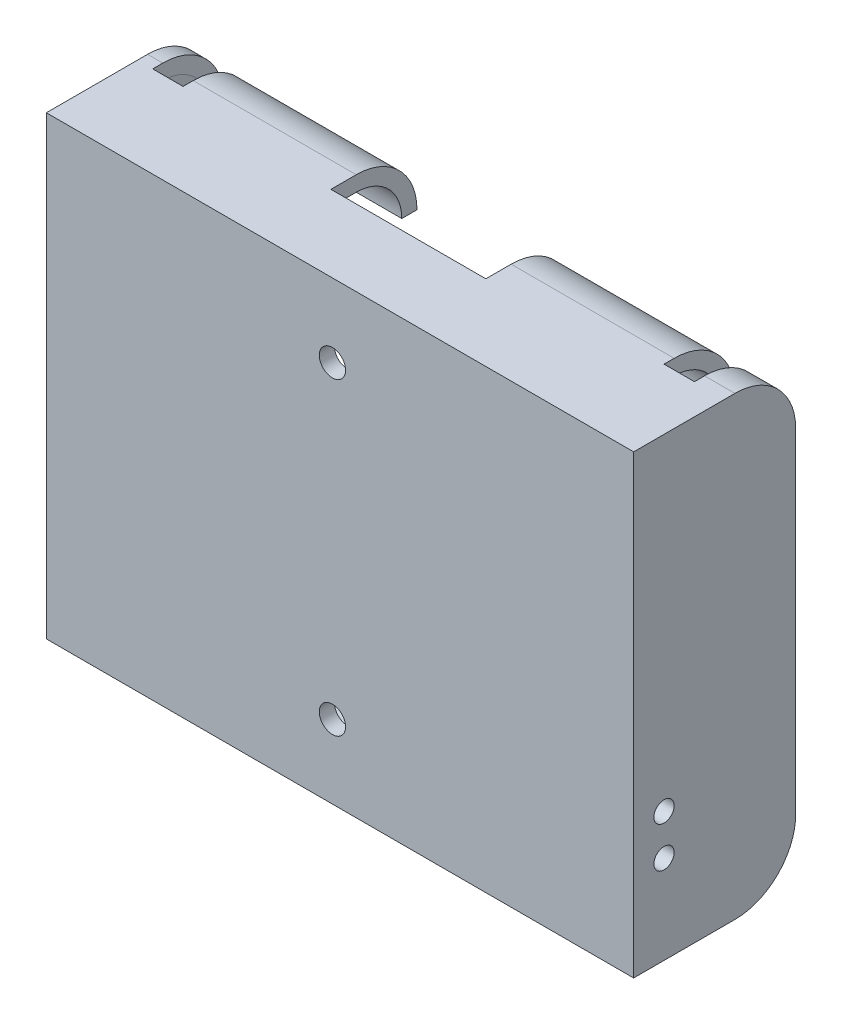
ISO-10303-21;
HEADER;
FILE_DESCRIPTION(('STEP AP214'),'2;1');
FILE_NAME('part.step','',(''),(''),'','','');
FILE_SCHEMA(('AUTOMOTIVE_DESIGN { 1 0 10303 214 1 1 1 1 }'));
ENDSEC;
DATA;
#1=APPLICATION_CONTEXT('core data for automotive mechanical design processes');
#2=APPLICATION_PROTOCOL_DEFINITION('international standard','automotive_design',2000,#1);
#3=PRODUCT_CONTEXT('',#1,'mechanical');
#4=PRODUCT('Part','Part','',(#3));
#5=PRODUCT_RELATED_PRODUCT_CATEGORY('part','',(#4));
#6=PRODUCT_DEFINITION_FORMATION('','',#4);
#7=PRODUCT_DEFINITION_CONTEXT('part definition',#1,'design');
#8=PRODUCT_DEFINITION('design','',#6,#7);
#9=PRODUCT_DEFINITION_SHAPE('','',#8);
#10=(LENGTH_UNIT() NAMED_UNIT(*) SI_UNIT(.MILLI.,.METRE.));
#11=(NAMED_UNIT(*) PLANE_ANGLE_UNIT() SI_UNIT($,.RADIAN.));
#12=(NAMED_UNIT(*) SI_UNIT($,.STERADIAN.) SOLID_ANGLE_UNIT());
#13=UNCERTAINTY_MEASURE_WITH_UNIT(LENGTH_MEASURE(1.E-05),#10,'distance_accuracy_value','');
#14=(GEOMETRIC_REPRESENTATION_CONTEXT(3) GLOBAL_UNCERTAINTY_ASSIGNED_CONTEXT((#13)) GLOBAL_UNIT_ASSIGNED_CONTEXT((#10,
#11,#12)) REPRESENTATION_CONTEXT('',''));
#15=CARTESIAN_POINT('',(0.,0.,0.));
#16=DIRECTION('',(0.,0.,1.));
#17=DIRECTION('',(1.,0.,0.));
#18=AXIS2_PLACEMENT_3D('',#15,#16,#17);
#19=CARTESIAN_POINT('',(-28.2544454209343,-4.75000002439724,-10.));
#20=DIRECTION('',(-1.,0.,0.));
#21=DIRECTION('',(0.,0.,1.));
#22=AXIS2_PLACEMENT_3D('',#19,#20,#21);
#23=CYLINDRICAL_SURFACE('',#22,6.);
#24=CARTESIAN_POINT('',(26.75,-4.75000002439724,-10.));
#25=DIRECTION('',(1.,0.,0.));
#26=DIRECTION('',(0.,1.,0.));
#27=AXIS2_PLACEMENT_3D('',#24,#25,#26);
#28=CIRCLE('',#27,6.);
#29=CARTESIAN_POINT('',(26.75,-4.75000002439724,-16.));
#30=VERTEX_POINT('',#29);
#31=CARTESIAN_POINT('',(26.75,-10.7500000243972,-10.));
#32=VERTEX_POINT('',#31);
#33=EDGE_CURVE('E411',#30,#32,#28,.F.);
#34=ORIENTED_EDGE('',*,*,#33,.F.);
#35=DIRECTION('',(1.,0.,0.));
#36=VECTOR('',#35,1.);
#37=CARTESIAN_POINT('',(-28.2544454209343,-4.75000002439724,-16.));
#38=LINE('',#37,#36);
#39=CARTESIAN_POINT('',(28.2461472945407,-4.75000002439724,-16.));
#40=VERTEX_POINT('',#39);
#41=EDGE_CURVE('E563',#40,#30,#38,.F.);
#42=ORIENTED_EDGE('',*,*,#41,.F.);
#43=DIRECTION('',(1.,0.,0.));
#44=VECTOR('',#43,1.);
#45=CARTESIAN_POINT('',(-28.2544454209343,-4.75000002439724,-16.));
#46=LINE('',#45,#44);
#47=CARTESIAN_POINT('',(29.7461473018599,-4.75000002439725,-16.));
#48=VERTEX_POINT('',#47);
#49=EDGE_CURVE('E673',#48,#40,#46,.F.);
#50=ORIENTED_EDGE('',*,*,#49,.F.);
#51=CARTESIAN_POINT('',(29.7461473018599,-4.75000002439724,-10.));
#52=DIRECTION('',(0.999999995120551,-9.87871318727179E-05,0.));
#53=DIRECTION('',(-9.87871318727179E-05,-0.999999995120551,0.));
#54=AXIS2_PLACEMENT_3D('',#51,#52,#53);
#55=ELLIPSE('',#54,6.00000002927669,6.);
#56=CARTESIAN_POINT('',(29.7455545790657,-10.7500000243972,-10.));
#57=VERTEX_POINT('',#56);
#58=EDGE_CURVE('E666',#57,#48,#55,.T.);
#59=ORIENTED_EDGE('',*,*,#58,.F.);
#60=DIRECTION('',(1.,0.,0.));
#61=VECTOR('',#60,1.);
#62=CARTESIAN_POINT('',(29.7455545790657,-10.7500000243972,-10.));
#63=LINE('',#62,#61);
#64=EDGE_CURVE('E654',#32,#57,#63,.T.);
#65=ORIENTED_EDGE('',*,*,#64,.F.);
#66=EDGE_LOOP('',(#34,#42,#50,#59,#65));
#67=FACE_BOUND('',#66,.T.);
#68=ADVANCED_FACE('F33',(#67),#23,.T.);
#69=CARTESIAN_POINT('',(-28.25,28.2499997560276,-10.));
#70=DIRECTION('',(1.,0.,0.));
#71=DIRECTION('',(0.,1.,0.));
#72=AXIS2_PLACEMENT_3D('',#69,#70,#71);
#73=CYLINDRICAL_SURFACE('',#72,6.);
#74=CARTESIAN_POINT('',(26.75,28.2499997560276,-10.));
#75=DIRECTION('',(1.,0.,0.));
#76=DIRECTION('',(0.,1.,0.));
#77=AXIS2_PLACEMENT_3D('',#74,#75,#76);
#78=CIRCLE('',#77,6.);
#79=CARTESIAN_POINT('',(26.75,34.2499997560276,-10.));
#80=VERTEX_POINT('',#79);
#81=CARTESIAN_POINT('',(26.75,28.2499997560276,-16.));
#82=VERTEX_POINT('',#81);
#83=EDGE_CURVE('E422',#80,#82,#78,.F.);
#84=ORIENTED_EDGE('',*,*,#83,.F.);
#85=DIRECTION('',(-1.,0.,0.));
#86=VECTOR('',#85,1.);
#87=CARTESIAN_POINT('',(-28.25,34.2499997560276,-10.));
#88=LINE('',#87,#86);
#89=CARTESIAN_POINT('',(29.75,34.2499997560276,-10.));
#90=VERTEX_POINT('',#89);
#91=EDGE_CURVE('E681',#90,#80,#88,.T.);
#92=ORIENTED_EDGE('',*,*,#91,.F.);
#93=CARTESIAN_POINT('',(29.7494072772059,28.2499997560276,-10.));
#94=DIRECTION('',(0.999999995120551,-9.87871318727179E-05,0.));
#95=DIRECTION('',(9.87871318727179E-05,0.999999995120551,0.));
#96=AXIS2_PLACEMENT_3D('',#93,#94,#95);
#97=ELLIPSE('',#96,6.00000002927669,6.);
#98=CARTESIAN_POINT('',(29.7494072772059,28.2499997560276,-16.));
#99=VERTEX_POINT('',#98);
#100=EDGE_CURVE('E663',#99,#90,#97,.T.);
#101=ORIENTED_EDGE('',*,*,#100,.F.);
#102=DIRECTION('',(-1.,0.,0.));
#103=VECTOR('',#102,1.);
#104=CARTESIAN_POINT('',(29.75,28.2499997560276,-16.));
#105=LINE('',#104,#103);
#106=CARTESIAN_POINT('',(28.2494072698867,28.2499997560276,-16.));
#107=VERTEX_POINT('',#106);
#108=EDGE_CURVE('E668',#107,#99,#105,.F.);
#109=ORIENTED_EDGE('',*,*,#108,.F.);
#110=DIRECTION('',(-1.,0.,0.));
#111=VECTOR('',#110,1.);
#112=CARTESIAN_POINT('',(29.75,28.2499997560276,-16.));
#113=LINE('',#112,#111);
#114=EDGE_CURVE('E562',#82,#107,#113,.F.);
#115=ORIENTED_EDGE('',*,*,#114,.F.);
#116=EDGE_LOOP('',(#84,#92,#101,#109,#115));
#117=FACE_BOUND('',#116,.T.);
#118=ADVANCED_FACE('F858',(#117),#73,.T.);
#119=CARTESIAN_POINT('',(29.75,28.2499997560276,-16.));
#120=DIRECTION('',(0.,1.,0.));
#121=DIRECTION('',(-1.,0.,0.));
#122=AXIS2_PLACEMENT_3D('',#119,#120,#121);
#123=PLANE('',#122);
#124=DIRECTION('',(1.,0.,0.));
#125=VECTOR('',#124,1.);
#126=CARTESIAN_POINT('',(0.74940727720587,28.2499997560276,-14.5));
#127=LINE('',#126,#125);
#128=CARTESIAN_POINT('',(26.75,28.2499997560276,-14.5));
#129=VERTEX_POINT('',#128);
#130=CARTESIAN_POINT('',(28.2494072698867,28.2499997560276,-14.5));
#131=VERTEX_POINT('',#130);
#132=EDGE_CURVE('E620',#129,#131,#127,.T.);
#133=ORIENTED_EDGE('',*,*,#132,.F.);
#134=DIRECTION('',(0.,0.,-1.));
#135=VECTOR('',#134,1.);
#136=CARTESIAN_POINT('',(26.75,28.2499997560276,-16.));
#137=LINE('',#136,#135);
#138=EDGE_CURVE('E419',#129,#82,#137,.T.);
#139=ORIENTED_EDGE('',*,*,#138,.T.);
#140=ORIENTED_EDGE('',*,*,#114,.T.);
#141=DIRECTION('',(0.,0.,-1.));
#142=VECTOR('',#141,1.);
#143=CARTESIAN_POINT('',(28.2494072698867,28.2499997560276,-16.));
#144=LINE('',#143,#142);
#145=EDGE_CURVE('E614',#131,#107,#144,.T.);
#146=ORIENTED_EDGE('',*,*,#145,.F.);
#147=EDGE_LOOP('',(#133,#139,#140,#146));
#148=FACE_BOUND('',#147,.T.);
#149=ADVANCED_FACE('F879',(#148),#123,.F.);
#150=CARTESIAN_POINT('',(-28.2544454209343,-4.75000002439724,-16.));
#151=DIRECTION('',(0.,-1.,0.));
#152=DIRECTION('',(1.,0.,0.));
#153=AXIS2_PLACEMENT_3D('',#150,#151,#152);
#154=PLANE('',#153);
#155=ORIENTED_EDGE('',*,*,#41,.T.);
#156=DIRECTION('',(0.,0.,1.));
#157=VECTOR('',#156,1.);
#158=CARTESIAN_POINT('',(26.75,-4.75000002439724,-16.));
#159=LINE('',#158,#157);
#160=CARTESIAN_POINT('',(26.75,-4.75000002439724,-14.5));
#161=VERTEX_POINT('',#160);
#162=EDGE_CURVE('E408',#30,#161,#159,.T.);
#163=ORIENTED_EDGE('',*,*,#162,.T.);
#164=DIRECTION('',(-1.,0.,0.));
#165=VECTOR('',#164,1.);
#166=CARTESIAN_POINT('',(0.746147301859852,-4.75000002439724,-14.5));
#167=LINE('',#166,#165);
#168=CARTESIAN_POINT('',(28.2461472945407,-4.75000002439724,-14.5));
#169=VERTEX_POINT('',#168);
#170=EDGE_CURVE('E628',#169,#161,#167,.T.);
#171=ORIENTED_EDGE('',*,*,#170,.F.);
#172=DIRECTION('',(0.,0.,-1.));
#173=VECTOR('',#172,1.);
#174=CARTESIAN_POINT('',(28.2461472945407,-4.75000002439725,-16.));
#175=LINE('',#174,#173);
#176=EDGE_CURVE('E623',#169,#40,#175,.T.);
#177=ORIENTED_EDGE('',*,*,#176,.T.);
#178=EDGE_LOOP('',(#155,#163,#171,#177));
#179=FACE_BOUND('',#178,.T.);
#180=ADVANCED_FACE('F850',(#179),#154,.F.);
#181=CARTESIAN_POINT('',(-28.2544454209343,-4.75000002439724,-10.));
#182=DIRECTION('',(-1.,0.,0.));
#183=DIRECTION('',(0.,0.,1.));
#184=AXIS2_PLACEMENT_3D('',#181,#182,#183);
#185=CYLINDRICAL_SURFACE('',#184,4.5);
#186=ORIENTED_EDGE('',*,*,#170,.T.);
#187=CARTESIAN_POINT('',(26.75,-4.75000002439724,-10.));
#188=DIRECTION('',(1.,0.,0.));
#189=DIRECTION('',(0.,1.,0.));
#190=AXIS2_PLACEMENT_3D('',#187,#188,#189);
#191=CIRCLE('',#190,4.5);
#192=CARTESIAN_POINT('',(26.75,-9.25000002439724,-10.));
#193=VERTEX_POINT('',#192);
#194=EDGE_CURVE('E405',#161,#193,#191,.F.);
#195=ORIENTED_EDGE('',*,*,#194,.T.);
#196=DIRECTION('',(1.,0.,0.));
#197=VECTOR('',#196,1.);
#198=CARTESIAN_POINT('',(-28.2544454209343,-9.25000002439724,-10.));
#199=LINE('',#198,#197);
#200=CARTESIAN_POINT('',(28.2457027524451,-9.25000002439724,-10.));
#201=VERTEX_POINT('',#200);
#202=EDGE_CURVE('E580',#193,#201,#199,.T.);
#203=ORIENTED_EDGE('',*,*,#202,.T.);
#204=CARTESIAN_POINT('',(28.2461472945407,-4.75000002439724,-10.));
#205=DIRECTION('',(0.999999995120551,-9.87871318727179E-05,0.));
#206=DIRECTION('',(-9.87871318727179E-05,-0.999999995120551,0.));
#207=AXIS2_PLACEMENT_3D('',#204,#205,#206);
#208=ELLIPSE('',#207,4.50000002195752,4.5);
#209=EDGE_CURVE('E596',#201,#169,#208,.T.);
#210=ORIENTED_EDGE('',*,*,#209,.T.);
#211=EDGE_LOOP('',(#186,#195,#203,#210));
#212=FACE_BOUND('',#211,.T.);
#213=ADVANCED_FACE('F847',(#212),#185,.F.);
#214=CARTESIAN_POINT('',(-28.25,28.2499997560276,-10.));
#215=DIRECTION('',(1.,0.,0.));
#216=DIRECTION('',(0.,1.,0.));
#217=AXIS2_PLACEMENT_3D('',#214,#215,#216);
#218=CYLINDRICAL_SURFACE('',#217,4.5);
#219=DIRECTION('',(-1.,0.,0.));
#220=VECTOR('',#219,1.);
#221=CARTESIAN_POINT('',(-28.25,32.7499997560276,-10.));
#222=LINE('',#221,#220);
#223=CARTESIAN_POINT('',(28.2498518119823,32.7499997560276,-10.));
#224=VERTEX_POINT('',#223);
#225=CARTESIAN_POINT('',(26.75,32.7499997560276,-10.));
#226=VERTEX_POINT('',#225);
#227=EDGE_CURVE('E585',#224,#226,#222,.T.);
#228=ORIENTED_EDGE('',*,*,#227,.T.);
#229=CARTESIAN_POINT('',(26.75,28.2499997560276,-10.));
#230=DIRECTION('',(1.,0.,0.));
#231=DIRECTION('',(0.,1.,0.));
#232=AXIS2_PLACEMENT_3D('',#229,#230,#231);
#233=CIRCLE('',#232,4.5);
#234=EDGE_CURVE('E416',#226,#129,#233,.F.);
#235=ORIENTED_EDGE('',*,*,#234,.T.);
#236=ORIENTED_EDGE('',*,*,#132,.T.);
#237=CARTESIAN_POINT('',(28.2494072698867,28.2499997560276,-10.));
#238=DIRECTION('',(0.999999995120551,-9.87871318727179E-05,0.));
#239=DIRECTION('',(9.87871318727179E-05,0.999999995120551,0.));
#240=AXIS2_PLACEMENT_3D('',#237,#238,#239);
#241=ELLIPSE('',#240,4.50000002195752,4.5);
#242=EDGE_CURVE('E599',#131,#224,#241,.T.);
#243=ORIENTED_EDGE('',*,*,#242,.T.);
#244=EDGE_LOOP('',(#228,#235,#236,#243));
#245=FACE_BOUND('',#244,.T.);
#246=ADVANCED_FACE('F885',(#245),#218,.F.);
#247=CARTESIAN_POINT('',(-7.65,-4.75000002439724,-10.));
#248=DIRECTION('',(-1.,0.,0.));
#249=DIRECTION('',(0.,-1.,0.));
#250=AXIS2_PLACEMENT_3D('',#247,#248,#249);
#251=CIRCLE('',#250,6.);
#252=CARTESIAN_POINT('',(-7.65,-10.7500000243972,-10.));
#253=VERTEX_POINT('',#252);
#254=CARTESIAN_POINT('',(-7.65,-4.75000002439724,-16.));
#255=VERTEX_POINT('',#254);
#256=EDGE_CURVE('E476',#253,#255,#251,.F.);
#257=ORIENTED_EDGE('',*,*,#256,.F.);
#258=CARTESIAN_POINT('',(-23.75,-10.7500000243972,-10.));
#259=VERTEX_POINT('',#258);
#260=EDGE_CURVE('E664',#259,#253,#63,.T.);
#261=ORIENTED_EDGE('',*,*,#260,.F.);
#262=CARTESIAN_POINT('',(-23.75,-4.75000002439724,-10.));
#263=DIRECTION('',(1.,0.,0.));
#264=DIRECTION('',(0.,1.,0.));
#265=AXIS2_PLACEMENT_3D('',#262,#263,#264);
#266=CIRCLE('',#265,6.);
#267=CARTESIAN_POINT('',(-23.75,-4.75000002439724,-16.));
#268=VERTEX_POINT('',#267);
#269=EDGE_CURVE('E551',#268,#259,#266,.F.);
#270=ORIENTED_EDGE('',*,*,#269,.F.);
#271=EDGE_CURVE('E775',#255,#268,#38,.F.);
#272=ORIENTED_EDGE('',*,*,#271,.F.);
#273=EDGE_LOOP('',(#257,#261,#270,#272));
#274=FACE_BOUND('',#273,.T.);
#275=ADVANCED_FACE('F834',(#274),#23,.T.);
#276=CARTESIAN_POINT('',(-7.65,28.2499997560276,-10.));
#277=DIRECTION('',(-1.,0.,0.));
#278=DIRECTION('',(0.,-1.,0.));
#279=AXIS2_PLACEMENT_3D('',#276,#277,#278);
#280=CIRCLE('',#279,6.);
#281=CARTESIAN_POINT('',(-7.65,28.2499997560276,-16.));
#282=VERTEX_POINT('',#281);
#283=CARTESIAN_POINT('',(-7.65,34.2499997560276,-10.));
#284=VERTEX_POINT('',#283);
#285=EDGE_CURVE('E487',#282,#284,#280,.F.);
#286=ORIENTED_EDGE('',*,*,#285,.F.);
#287=CARTESIAN_POINT('',(-23.75,28.2499997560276,-16.));
#288=VERTEX_POINT('',#287);
#289=EDGE_CURVE('E561',#288,#282,#113,.F.);
#290=ORIENTED_EDGE('',*,*,#289,.F.);
#291=CARTESIAN_POINT('',(-23.75,28.2499997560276,-10.));
#292=DIRECTION('',(1.,0.,0.));
#293=DIRECTION('',(0.,1.,0.));
#294=AXIS2_PLACEMENT_3D('',#291,#292,#293);
#295=CIRCLE('',#294,6.);
#296=CARTESIAN_POINT('',(-23.75,34.2499997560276,-10.));
#297=VERTEX_POINT('',#296);
#298=EDGE_CURVE('E540',#297,#288,#295,.F.);
#299=ORIENTED_EDGE('',*,*,#298,.F.);
#300=EDGE_CURVE('E939',#284,#297,#88,.T.);
#301=ORIENTED_EDGE('',*,*,#300,.F.);
#302=EDGE_LOOP('',(#286,#290,#299,#301));
#303=FACE_BOUND('',#302,.T.);
#304=ADVANCED_FACE('F881',(#303),#73,.T.);
#305=ORIENTED_EDGE('',*,*,#289,.T.);
#306=DIRECTION('',(0.,0.,1.));
#307=VECTOR('',#306,1.);
#308=CARTESIAN_POINT('',(-7.65,28.2499997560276,-16.));
#309=LINE('',#308,#307);
#310=CARTESIAN_POINT('',(-7.65,28.2499997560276,-14.5));
#311=VERTEX_POINT('',#310);
#312=EDGE_CURVE('E484',#282,#311,#309,.T.);
#313=ORIENTED_EDGE('',*,*,#312,.T.);
#314=CARTESIAN_POINT('',(-23.75,28.2499997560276,-14.5));
#315=VERTEX_POINT('',#314);
#316=EDGE_CURVE('E619',#315,#311,#127,.T.);
#317=ORIENTED_EDGE('',*,*,#316,.F.);
#318=DIRECTION('',(0.,0.,-1.));
#319=VECTOR('',#318,1.);
#320=CARTESIAN_POINT('',(-23.75,28.2499997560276,-16.));
#321=LINE('',#320,#319);
#322=EDGE_CURVE('E537',#315,#288,#321,.T.);
#323=ORIENTED_EDGE('',*,*,#322,.T.);
#324=EDGE_LOOP('',(#305,#313,#317,#323));
#325=FACE_BOUND('',#324,.T.);
#326=ADVANCED_FACE('F964',(#325),#123,.F.);
#327=CARTESIAN_POINT('',(-7.65,-4.75000002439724,-14.5));
#328=VERTEX_POINT('',#327);
#329=CARTESIAN_POINT('',(-23.75,-4.75000002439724,-14.5));
#330=VERTEX_POINT('',#329);
#331=EDGE_CURVE('E769',#328,#330,#167,.T.);
#332=ORIENTED_EDGE('',*,*,#331,.F.);
#333=DIRECTION('',(0.,0.,-1.));
#334=VECTOR('',#333,1.);
#335=CARTESIAN_POINT('',(-7.65,-4.75000002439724,-16.));
#336=LINE('',#335,#334);
#337=EDGE_CURVE('E473',#328,#255,#336,.T.);
#338=ORIENTED_EDGE('',*,*,#337,.T.);
#339=ORIENTED_EDGE('',*,*,#271,.T.);
#340=DIRECTION('',(0.,0.,1.));
#341=VECTOR('',#340,1.);
#342=CARTESIAN_POINT('',(-23.75,-4.75000002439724,-16.));
#343=LINE('',#342,#341);
#344=EDGE_CURVE('E548',#268,#330,#343,.T.);
#345=ORIENTED_EDGE('',*,*,#344,.T.);
#346=EDGE_LOOP('',(#332,#338,#339,#345));
#347=FACE_BOUND('',#346,.T.);
#348=ADVANCED_FACE('F909',(#347),#154,.F.);
#349=CARTESIAN_POINT('',(-23.75,-9.25000002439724,-10.));
#350=VERTEX_POINT('',#349);
#351=CARTESIAN_POINT('',(-7.65,-9.25000002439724,-10.));
#352=VERTEX_POINT('',#351);
#353=EDGE_CURVE('E606',#350,#352,#199,.T.);
#354=ORIENTED_EDGE('',*,*,#353,.T.);
#355=CARTESIAN_POINT('',(-7.65,-4.75000002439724,-10.));
#356=DIRECTION('',(-1.,0.,0.));
#357=DIRECTION('',(0.,-1.,0.));
#358=AXIS2_PLACEMENT_3D('',#355,#356,#357);
#359=CIRCLE('',#358,4.5);
#360=EDGE_CURVE('E470',#352,#328,#359,.F.);
#361=ORIENTED_EDGE('',*,*,#360,.T.);
#362=ORIENTED_EDGE('',*,*,#331,.T.);
#363=CARTESIAN_POINT('',(-23.75,-4.75000002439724,-10.));
#364=DIRECTION('',(1.,0.,0.));
#365=DIRECTION('',(0.,1.,0.));
#366=AXIS2_PLACEMENT_3D('',#363,#364,#365);
#367=CIRCLE('',#366,4.5);
#368=EDGE_CURVE('E542',#330,#350,#367,.F.);
#369=ORIENTED_EDGE('',*,*,#368,.T.);
#370=EDGE_LOOP('',(#354,#361,#362,#369));
#371=FACE_BOUND('',#370,.T.);
#372=ADVANCED_FACE('F903',(#371),#185,.F.);
#373=ORIENTED_EDGE('',*,*,#316,.T.);
#374=CARTESIAN_POINT('',(-7.65,28.2499997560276,-10.));
#375=DIRECTION('',(-1.,0.,0.));
#376=DIRECTION('',(0.,-1.,0.));
#377=AXIS2_PLACEMENT_3D('',#374,#375,#376);
#378=CIRCLE('',#377,4.5);
#379=CARTESIAN_POINT('',(-7.65,32.7499997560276,-10.));
#380=VERTEX_POINT('',#379);
#381=EDGE_CURVE('E481',#311,#380,#378,.F.);
#382=ORIENTED_EDGE('',*,*,#381,.T.);
#383=CARTESIAN_POINT('',(-23.75,32.7499997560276,-10.));
#384=VERTEX_POINT('',#383);
#385=EDGE_CURVE('E976',#380,#384,#222,.T.);
#386=ORIENTED_EDGE('',*,*,#385,.T.);
#387=CARTESIAN_POINT('',(-23.75,28.2499997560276,-10.));
#388=DIRECTION('',(1.,0.,0.));
#389=DIRECTION('',(0.,1.,0.));
#390=AXIS2_PLACEMENT_3D('',#387,#388,#389);
#391=CIRCLE('',#390,4.5);
#392=EDGE_CURVE('E687',#384,#315,#391,.F.);
#393=ORIENTED_EDGE('',*,*,#392,.T.);
#394=EDGE_LOOP('',(#373,#382,#386,#393));
#395=FACE_BOUND('',#394,.T.);
#396=ADVANCED_FACE('F896',(#395),#218,.F.);
#397=CARTESIAN_POINT('',(23.75,-4.75000002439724,-10.));
#398=DIRECTION('',(-1.,0.,0.));
#399=DIRECTION('',(0.,-1.,0.));
#400=AXIS2_PLACEMENT_3D('',#397,#398,#399);
#401=CIRCLE('',#400,6.);
#402=CARTESIAN_POINT('',(23.75,-10.7500000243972,-10.));
#403=VERTEX_POINT('',#402);
#404=CARTESIAN_POINT('',(23.75,-4.75000002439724,-16.));
#405=VERTEX_POINT('',#404);
#406=EDGE_CURVE('E393',#403,#405,#401,.F.);
#407=ORIENTED_EDGE('',*,*,#406,.F.);
#408=CARTESIAN_POINT('',(7.65,-10.7500000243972,-10.));
#409=VERTEX_POINT('',#408);
#410=EDGE_CURVE('E794',#409,#403,#63,.T.);
#411=ORIENTED_EDGE('',*,*,#410,.F.);
#412=CARTESIAN_POINT('',(7.65,-4.75000002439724,-10.));
#413=DIRECTION('',(1.,0.,0.));
#414=DIRECTION('',(0.,1.,0.));
#415=AXIS2_PLACEMENT_3D('',#412,#413,#414);
#416=CIRCLE('',#415,6.);
#417=CARTESIAN_POINT('',(7.65,-4.75000002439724,-16.));
#418=VERTEX_POINT('',#417);
#419=EDGE_CURVE('E457',#418,#409,#416,.F.);
#420=ORIENTED_EDGE('',*,*,#419,.F.);
#421=EDGE_CURVE('E567',#405,#418,#38,.F.);
#422=ORIENTED_EDGE('',*,*,#421,.F.);
#423=EDGE_LOOP('',(#407,#411,#420,#422));
#424=FACE_BOUND('',#423,.T.);
#425=ADVANCED_FACE('F792',(#424),#23,.T.);
#426=CARTESIAN_POINT('',(23.75,28.2499997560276,-10.));
#427=DIRECTION('',(-1.,0.,0.));
#428=DIRECTION('',(0.,-1.,0.));
#429=AXIS2_PLACEMENT_3D('',#426,#427,#428);
#430=CIRCLE('',#429,6.);
#431=CARTESIAN_POINT('',(23.75,28.2499997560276,-16.));
#432=VERTEX_POINT('',#431);
#433=CARTESIAN_POINT('',(23.75,34.2499997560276,-10.));
#434=VERTEX_POINT('',#433);
#435=EDGE_CURVE('E366',#432,#434,#430,.F.);
#436=ORIENTED_EDGE('',*,*,#435,.F.);
#437=CARTESIAN_POINT('',(7.65,28.2499997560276,-16.));
#438=VERTEX_POINT('',#437);
#439=EDGE_CURVE('E951',#438,#432,#113,.F.);
#440=ORIENTED_EDGE('',*,*,#439,.F.);
#441=CARTESIAN_POINT('',(7.65,28.2499997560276,-10.));
#442=DIRECTION('',(1.,0.,0.));
#443=DIRECTION('',(0.,1.,0.));
#444=AXIS2_PLACEMENT_3D('',#441,#442,#443);
#445=CIRCLE('',#444,6.);
#446=CARTESIAN_POINT('',(7.65,34.2499997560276,-10.));
#447=VERTEX_POINT('',#446);
#448=EDGE_CURVE('E468',#447,#438,#445,.F.);
#449=ORIENTED_EDGE('',*,*,#448,.F.);
#450=EDGE_CURVE('E684',#434,#447,#88,.T.);
#451=ORIENTED_EDGE('',*,*,#450,.F.);
#452=EDGE_LOOP('',(#436,#440,#449,#451));
#453=FACE_BOUND('',#452,.T.);
#454=ADVANCED_FACE('F893',(#453),#73,.T.);
#455=ORIENTED_EDGE('',*,*,#439,.T.);
#456=DIRECTION('',(0.,0.,1.));
#457=VECTOR('',#456,1.);
#458=CARTESIAN_POINT('',(23.75,28.2499997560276,-16.));
#459=LINE('',#458,#457);
#460=CARTESIAN_POINT('',(23.75,28.2499997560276,-14.5));
#461=VERTEX_POINT('',#460);
#462=EDGE_CURVE('E400',#432,#461,#459,.T.);
#463=ORIENTED_EDGE('',*,*,#462,.T.);
#464=CARTESIAN_POINT('',(7.65,28.2499997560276,-14.5));
#465=VERTEX_POINT('',#464);
#466=EDGE_CURVE('E957',#465,#461,#127,.T.);
#467=ORIENTED_EDGE('',*,*,#466,.F.);
#468=DIRECTION('',(0.,0.,-1.));
#469=VECTOR('',#468,1.);
#470=CARTESIAN_POINT('',(7.65,28.2499997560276,-16.));
#471=LINE('',#470,#469);
#472=EDGE_CURVE('E465',#465,#438,#471,.T.);
#473=ORIENTED_EDGE('',*,*,#472,.T.);
#474=EDGE_LOOP('',(#455,#463,#467,#473));
#475=FACE_BOUND('',#474,.T.);
#476=ADVANCED_FACE('F901',(#475),#123,.F.);
#477=CARTESIAN_POINT('',(23.75,-4.75000002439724,-14.5));
#478=VERTEX_POINT('',#477);
#479=CARTESIAN_POINT('',(7.65,-4.75000002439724,-14.5));
#480=VERTEX_POINT('',#479);
#481=EDGE_CURVE('E631',#478,#480,#167,.T.);
#482=ORIENTED_EDGE('',*,*,#481,.F.);
#483=DIRECTION('',(0.,0.,-1.));
#484=VECTOR('',#483,1.);
#485=CARTESIAN_POINT('',(23.75,-4.75000002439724,-16.));
#486=LINE('',#485,#484);
#487=EDGE_CURVE('E390',#478,#405,#486,.T.);
#488=ORIENTED_EDGE('',*,*,#487,.T.);
#489=ORIENTED_EDGE('',*,*,#421,.T.);
#490=DIRECTION('',(0.,0.,1.));
#491=VECTOR('',#490,1.);
#492=CARTESIAN_POINT('',(7.65,-4.75000002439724,-16.));
#493=LINE('',#492,#491);
#494=EDGE_CURVE('E454',#418,#480,#493,.T.);
#495=ORIENTED_EDGE('',*,*,#494,.T.);
#496=EDGE_LOOP('',(#482,#488,#489,#495));
#497=FACE_BOUND('',#496,.T.);
#498=ADVANCED_FACE('F783',(#497),#154,.F.);
#499=CARTESIAN_POINT('',(7.65,-9.25000002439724,-10.));
#500=VERTEX_POINT('',#499);
#501=CARTESIAN_POINT('',(23.75,-9.25000002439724,-10.));
#502=VERTEX_POINT('',#501);
#503=EDGE_CURVE('E843',#500,#502,#199,.T.);
#504=ORIENTED_EDGE('',*,*,#503,.T.);
#505=CARTESIAN_POINT('',(23.75,-4.75000002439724,-10.));
#506=DIRECTION('',(-1.,0.,0.));
#507=DIRECTION('',(0.,-1.,0.));
#508=AXIS2_PLACEMENT_3D('',#505,#506,#507);
#509=CIRCLE('',#508,4.5);
#510=EDGE_CURVE('E58',#502,#478,#509,.F.);
#511=ORIENTED_EDGE('',*,*,#510,.T.);
#512=ORIENTED_EDGE('',*,*,#481,.T.);
#513=CARTESIAN_POINT('',(7.65,-4.75000002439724,-10.));
#514=DIRECTION('',(1.,0.,0.));
#515=DIRECTION('',(0.,1.,0.));
#516=AXIS2_PLACEMENT_3D('',#513,#514,#515);
#517=CIRCLE('',#516,4.5);
#518=EDGE_CURVE('E451',#480,#500,#517,.F.);
#519=ORIENTED_EDGE('',*,*,#518,.T.);
#520=EDGE_LOOP('',(#504,#511,#512,#519));
#521=FACE_BOUND('',#520,.T.);
#522=ADVANCED_FACE('F912',(#521),#185,.F.);
#523=ORIENTED_EDGE('',*,*,#466,.T.);
#524=CARTESIAN_POINT('',(23.75,28.2499997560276,-10.));
#525=DIRECTION('',(-1.,0.,0.));
#526=DIRECTION('',(0.,-1.,0.));
#527=AXIS2_PLACEMENT_3D('',#524,#525,#526);
#528=CIRCLE('',#527,4.5);
#529=CARTESIAN_POINT('',(23.75,32.7499997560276,-10.));
#530=VERTEX_POINT('',#529);
#531=EDGE_CURVE('E397',#461,#530,#528,.F.);
#532=ORIENTED_EDGE('',*,*,#531,.T.);
#533=CARTESIAN_POINT('',(7.65,32.7499997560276,-10.));
#534=VERTEX_POINT('',#533);
#535=EDGE_CURVE('E589',#530,#534,#222,.T.);
#536=ORIENTED_EDGE('',*,*,#535,.T.);
#537=CARTESIAN_POINT('',(7.65,28.2499997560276,-10.));
#538=DIRECTION('',(1.,0.,0.));
#539=DIRECTION('',(0.,1.,0.));
#540=AXIS2_PLACEMENT_3D('',#537,#538,#539);
#541=CIRCLE('',#540,4.5);
#542=EDGE_CURVE('E462',#534,#465,#541,.F.);
#543=ORIENTED_EDGE('',*,*,#542,.T.);
#544=EDGE_LOOP('',(#523,#532,#536,#543));
#545=FACE_BOUND('',#544,.T.);
#546=ADVANCED_FACE('F871',(#545),#218,.F.);
#547=CARTESIAN_POINT('',(-28.25,34.2499997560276,-16.));
#548=DIRECTION('',(0.,0.,1.));
#549=DIRECTION('',(1.,0.,0.));
#550=AXIS2_PLACEMENT_3D('',#547,#548,#549);
#551=PLANE('',#550);
#552=ORIENTED_EDGE('',*,*,#49,.T.);
#553=DIRECTION('',(9.87871318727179E-05,0.999999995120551,0.));
#554=VECTOR('',#553,1.);
#555=CARTESIAN_POINT('',(28.2499994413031,34.2444182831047,-16.));
#556=LINE('',#555,#554);
#557=EDGE_CURVE('E574',#40,#107,#556,.T.);
#558=ORIENTED_EDGE('',*,*,#557,.T.);
#559=ORIENTED_EDGE('',*,*,#108,.T.);
#560=DIRECTION('',(9.87871318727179E-05,0.999999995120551,0.));
#561=VECTOR('',#560,1.);
#562=CARTESIAN_POINT('',(29.75,34.2499997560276,-16.));
#563=LINE('',#562,#561);
#564=EDGE_CURVE('E648',#48,#99,#563,.T.);
#565=ORIENTED_EDGE('',*,*,#564,.F.);
#566=EDGE_LOOP('',(#552,#558,#559,#565));
#567=FACE_BOUND('',#566,.T.);
#568=ADVANCED_FACE('F852',(#567),#551,.F.);
#569=CARTESIAN_POINT('',(-28.25,34.2499997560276,-16.));
#570=DIRECTION('',(-0.999999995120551,9.87871318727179E-05,0.));
#571=DIRECTION('',(-9.87871318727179E-05,-0.999999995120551,0.));
#572=AXIS2_PLACEMENT_3D('',#569,#570,#571);
#573=PLANE('',#572);
#574=DIRECTION('',(-9.87871318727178E-05,-0.999999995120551,0.));
#575=VECTOR('',#574,1.);
#576=CARTESIAN_POINT('',(-28.25,34.2499997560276,-16.));
#577=LINE('',#576,#575);
#578=CARTESIAN_POINT('',(-28.2505927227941,28.2499997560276,-16.));
#579=VERTEX_POINT('',#578);
#580=CARTESIAN_POINT('',(-28.2538526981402,-4.75000002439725,-16.));
#581=VERTEX_POINT('',#580);
#582=EDGE_CURVE('E645',#579,#581,#577,.T.);
#583=ORIENTED_EDGE('',*,*,#582,.T.);
#584=CARTESIAN_POINT('',(-28.2538526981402,-4.75000002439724,-10.));
#585=DIRECTION('',(-0.999999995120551,9.87871318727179E-05,0.));
#586=DIRECTION('',(-9.87871318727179E-05,-0.999999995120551,0.));
#587=AXIS2_PLACEMENT_3D('',#584,#585,#586);
#588=ELLIPSE('',#587,6.00000002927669,6.);
#589=CARTESIAN_POINT('',(-28.2544454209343,-10.7500000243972,-10.));
#590=VERTEX_POINT('',#589);
#591=EDGE_CURVE('E678',#581,#590,#588,.T.);
#592=ORIENTED_EDGE('',*,*,#591,.T.);
#593=DIRECTION('',(0.,0.,1.));
#594=VECTOR('',#593,1.);
#595=CARTESIAN_POINT('',(-28.2544454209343,-10.7500000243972,-16.));
#596=LINE('',#595,#594);
#597=CARTESIAN_POINT('',(-28.2544454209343,-10.7500000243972,0.));
#598=VERTEX_POINT('',#597);
#599=EDGE_CURVE('E651',#590,#598,#596,.T.);
#600=ORIENTED_EDGE('',*,*,#599,.T.);
#601=DIRECTION('',(-9.87871318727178E-05,-0.999999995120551,0.));
#602=VECTOR('',#601,1.);
#603=CARTESIAN_POINT('',(-28.25,34.2499997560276,0.));
#604=LINE('',#603,#602);
#605=CARTESIAN_POINT('',(-28.25,34.2499997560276,0.));
#606=VERTEX_POINT('',#605);
#607=EDGE_CURVE('E613',#606,#598,#604,.T.);
#608=ORIENTED_EDGE('',*,*,#607,.F.);
#609=DIRECTION('',(0.,0.,1.));
#610=VECTOR('',#609,1.);
#611=CARTESIAN_POINT('',(-28.25,34.2499997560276,-16.));
#612=LINE('',#611,#610);
#613=CARTESIAN_POINT('',(-28.25,34.2499997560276,-10.));
#614=VERTEX_POINT('',#613);
#615=EDGE_CURVE('E652',#614,#606,#612,.T.);
#616=ORIENTED_EDGE('',*,*,#615,.F.);
#617=CARTESIAN_POINT('',(-28.2505927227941,28.2499997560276,-10.));
#618=DIRECTION('',(-0.999999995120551,9.87871318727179E-05,0.));
#619=DIRECTION('',(9.87871318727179E-05,0.999999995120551,0.));
#620=AXIS2_PLACEMENT_3D('',#617,#618,#619);
#621=ELLIPSE('',#620,6.00000002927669,6.);
#622=EDGE_CURVE('E676',#614,#579,#621,.T.);
#623=ORIENTED_EDGE('',*,*,#622,.T.);
#624=EDGE_LOOP('',(#583,#592,#600,#608,#616,#623));
#625=FACE_BOUND('',#624,.T.);
#626=ADVANCED_FACE('F35',(#625),#573,.T.);
#627=CARTESIAN_POINT('',(-28.25,34.2499997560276,-16.));
#628=DIRECTION('',(0.,1.,0.));
#629=DIRECTION('',(-1.,0.,0.));
#630=AXIS2_PLACEMENT_3D('',#627,#628,#629);
#631=PLANE('',#630);
#632=DIRECTION('',(0.,0.,-1.));
#633=VECTOR('',#632,1.);
#634=CARTESIAN_POINT('',(26.75,34.2499997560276,-9.));
#635=LINE('',#634,#633);
#636=CARTESIAN_POINT('',(26.75,34.2499997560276,-9.));
#637=VERTEX_POINT('',#636);
#638=EDGE_CURVE('E369',#637,#80,#635,.T.);
#639=ORIENTED_EDGE('',*,*,#638,.F.);
#640=DIRECTION('',(1.,0.,0.));
#641=VECTOR('',#640,1.);
#642=CARTESIAN_POINT('',(26.75,34.2499997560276,-9.));
#643=LINE('',#642,#641);
#644=CARTESIAN_POINT('',(23.75,34.2499997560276,-9.));
#645=VERTEX_POINT('',#644);
#646=EDGE_CURVE('E354',#645,#637,#643,.T.);
#647=ORIENTED_EDGE('',*,*,#646,.F.);
#648=DIRECTION('',(0.,0.,1.));
#649=VECTOR('',#648,1.);
#650=CARTESIAN_POINT('',(23.75,34.2499997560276,-9.));
#651=LINE('',#650,#649);
#652=EDGE_CURVE('E363',#434,#645,#651,.T.);
#653=ORIENTED_EDGE('',*,*,#652,.F.);
#654=ORIENTED_EDGE('',*,*,#450,.T.);
#655=DIRECTION('',(0.,0.,-1.));
#656=VECTOR('',#655,1.);
#657=CARTESIAN_POINT('',(7.65,34.2499997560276,-7.5));
#658=LINE('',#657,#656);
#659=CARTESIAN_POINT('',(7.65,34.2499997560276,-7.5));
#660=VERTEX_POINT('',#659);
#661=EDGE_CURVE('E429',#660,#447,#658,.T.);
#662=ORIENTED_EDGE('',*,*,#661,.F.);
#663=DIRECTION('',(1.,0.,0.));
#664=VECTOR('',#663,1.);
#665=CARTESIAN_POINT('',(-7.65,34.2499997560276,-7.5));
#666=LINE('',#665,#664);
#667=CARTESIAN_POINT('',(-7.65,34.2499997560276,-7.5));
#668=VERTEX_POINT('',#667);
#669=EDGE_CURVE('E426',#668,#660,#666,.T.);
#670=ORIENTED_EDGE('',*,*,#669,.F.);
#671=DIRECTION('',(0.,0.,1.));
#672=VECTOR('',#671,1.);
#673=CARTESIAN_POINT('',(-7.65,34.2499997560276,-7.5));
#674=LINE('',#673,#672);
#675=EDGE_CURVE('E424',#284,#668,#674,.T.);
#676=ORIENTED_EDGE('',*,*,#675,.F.);
#677=ORIENTED_EDGE('',*,*,#300,.T.);
#678=DIRECTION('',(0.,0.,-1.));
#679=VECTOR('',#678,1.);
#680=CARTESIAN_POINT('',(-23.75,34.2499997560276,-9.));
#681=LINE('',#680,#679);
#682=CARTESIAN_POINT('',(-23.75,34.2499997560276,-9.));
#683=VERTEX_POINT('',#682);
#684=EDGE_CURVE('E489',#683,#297,#681,.T.);
#685=ORIENTED_EDGE('',*,*,#684,.F.);
#686=DIRECTION('',(1.,0.,0.));
#687=VECTOR('',#686,1.);
#688=CARTESIAN_POINT('',(-26.75,34.2499997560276,-9.));
#689=LINE('',#688,#687);
#690=CARTESIAN_POINT('',(-26.75,34.2499997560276,-9.));
#691=VERTEX_POINT('',#690);
#692=EDGE_CURVE('E495',#691,#683,#689,.T.);
#693=ORIENTED_EDGE('',*,*,#692,.F.);
#694=DIRECTION('',(0.,0.,1.));
#695=VECTOR('',#694,1.);
#696=CARTESIAN_POINT('',(-26.75,34.2499997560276,-9.));
#697=LINE('',#696,#695);
#698=CARTESIAN_POINT('',(-26.75,34.2499997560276,-10.));
#699=VERTEX_POINT('',#698);
#700=EDGE_CURVE('E492',#699,#691,#697,.T.);
#701=ORIENTED_EDGE('',*,*,#700,.F.);
#702=EDGE_CURVE('E680',#699,#614,#88,.T.);
#703=ORIENTED_EDGE('',*,*,#702,.T.);
#704=ORIENTED_EDGE('',*,*,#615,.T.);
#705=DIRECTION('',(-1.,0.,0.));
#706=VECTOR('',#705,1.);
#707=CARTESIAN_POINT('',(-28.25,34.2499997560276,0.));
#708=LINE('',#707,#706);
#709=CARTESIAN_POINT('',(29.75,34.2499997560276,0.));
#710=VERTEX_POINT('',#709);
#711=EDGE_CURVE('E642',#710,#606,#708,.T.);
#712=ORIENTED_EDGE('',*,*,#711,.F.);
#713=DIRECTION('',(0.,0.,1.));
#714=VECTOR('',#713,1.);
#715=CARTESIAN_POINT('',(29.75,34.2499997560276,-16.));
#716=LINE('',#715,#714);
#717=EDGE_CURVE('E655',#90,#710,#716,.T.);
#718=ORIENTED_EDGE('',*,*,#717,.F.);
#719=ORIENTED_EDGE('',*,*,#91,.T.);
#720=EDGE_LOOP('',(#639,#647,#653,#654,#662,#670,#676,#677,#685,#693,#701,#703,#704,#712,#718,#719));
#721=FACE_BOUND('',#720,.T.);
#722=ADVANCED_FACE('F371',(#721),#631,.T.);
#723=CARTESIAN_POINT('',(29.75,34.2499997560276,-16.));
#724=DIRECTION('',(0.999999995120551,-9.87871318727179E-05,0.));
#725=DIRECTION('',(9.87871318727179E-05,0.999999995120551,0.));
#726=AXIS2_PLACEMENT_3D('',#723,#724,#725);
#727=PLANE('',#726);
#728=CARTESIAN_POINT('',(29.746418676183,-2.00293857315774,-3.));
#729=DIRECTION('',(0.999999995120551,-9.87871318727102E-05,0.));
#730=DIRECTION('',(9.87871318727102E-05,0.999999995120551,0.));
#731=AXIS2_PLACEMENT_3D('',#728,#729,#730);
#732=CIRCLE('',#731,1.);
#733=CARTESIAN_POINT('',(29.7465174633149,-1.00293857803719,-3.));
#734=VERTEX_POINT('',#733);
#735=EDGE_CURVE('E715',#734,#734,#732,.T.);
#736=ORIENTED_EDGE('',*,*,#735,.F.);
#737=EDGE_LOOP('',(#736));
#738=FACE_BOUND('',#737,.T.);
#739=CARTESIAN_POINT('',(29.7468138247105,1.99706140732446,-3.));
#740=DIRECTION('',(0.999999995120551,-9.87871318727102E-05,0.));
#741=DIRECTION('',(9.87871318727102E-05,0.999999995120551,0.));
#742=AXIS2_PLACEMENT_3D('',#739,#740,#741);
#743=CIRCLE('',#742,1.);
#744=CARTESIAN_POINT('',(29.7469126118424,2.99706140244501,-3.));
#745=VERTEX_POINT('',#744);
#746=EDGE_CURVE('E707',#745,#745,#743,.T.);
#747=ORIENTED_EDGE('',*,*,#746,.F.);
#748=EDGE_LOOP('',(#747));
#749=FACE_BOUND('',#748,.T.);
#750=DIRECTION('',(0.,0.,1.));
#751=VECTOR('',#750,1.);
#752=CARTESIAN_POINT('',(29.7455545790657,-10.7500000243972,-16.));
#753=LINE('',#752,#751);
#754=CARTESIAN_POINT('',(29.7455545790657,-10.7500000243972,0.));
#755=VERTEX_POINT('',#754);
#756=EDGE_CURVE('E657',#57,#755,#753,.T.);
#757=ORIENTED_EDGE('',*,*,#756,.F.);
#758=ORIENTED_EDGE('',*,*,#58,.T.);
#759=ORIENTED_EDGE('',*,*,#564,.T.);
#760=ORIENTED_EDGE('',*,*,#100,.T.);
#761=ORIENTED_EDGE('',*,*,#717,.T.);
#762=DIRECTION('',(9.87871318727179E-05,0.999999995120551,0.));
#763=VECTOR('',#762,1.);
#764=CARTESIAN_POINT('',(29.75,34.2499997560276,0.));
#765=LINE('',#764,#763);
#766=EDGE_CURVE('E639',#755,#710,#765,.T.);
#767=ORIENTED_EDGE('',*,*,#766,.F.);
#768=EDGE_LOOP('',(#757,#758,#759,#760,#761,#767));
#769=FACE_BOUND('',#768,.T.);
#770=ADVANCED_FACE('F810',(#738,#749,#769),#727,.T.);
#771=CARTESIAN_POINT('',(-28.2544454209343,-10.7500000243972,-16.));
#772=DIRECTION('',(0.,-1.,0.));
#773=DIRECTION('',(0.,0.,-1.));
#774=AXIS2_PLACEMENT_3D('',#771,#772,#773);
#775=PLANE('',#774);
#776=DIRECTION('',(0.,0.,-1.));
#777=VECTOR('',#776,1.);
#778=CARTESIAN_POINT('',(26.75,-10.7500000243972,-9.));
#779=LINE('',#778,#777);
#780=CARTESIAN_POINT('',(26.75,-10.7500000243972,-9.));
#781=VERTEX_POINT('',#780);
#782=EDGE_CURVE('E373',#781,#32,#779,.T.);
#783=ORIENTED_EDGE('',*,*,#782,.T.);
#784=ORIENTED_EDGE('',*,*,#64,.T.);
#785=ORIENTED_EDGE('',*,*,#756,.T.);
#786=DIRECTION('',(1.,0.,0.));
#787=VECTOR('',#786,1.);
#788=CARTESIAN_POINT('',(-28.2544454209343,-10.7500000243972,0.));
#789=LINE('',#788,#787);
#790=EDGE_CURVE('E636',#598,#755,#789,.T.);
#791=ORIENTED_EDGE('',*,*,#790,.F.);
#792=ORIENTED_EDGE('',*,*,#599,.F.);
#793=CARTESIAN_POINT('',(-26.75,-10.7500000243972,-10.));
#794=VERTEX_POINT('',#793);
#795=EDGE_CURVE('E660',#590,#794,#63,.T.);
#796=ORIENTED_EDGE('',*,*,#795,.T.);
#797=DIRECTION('',(0.,0.,1.));
#798=VECTOR('',#797,1.);
#799=CARTESIAN_POINT('',(-26.75,-10.7500000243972,-9.));
#800=LINE('',#799,#798);
#801=CARTESIAN_POINT('',(-26.75,-10.7500000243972,-9.));
#802=VERTEX_POINT('',#801);
#803=EDGE_CURVE('E501',#794,#802,#800,.T.);
#804=ORIENTED_EDGE('',*,*,#803,.T.);
#805=DIRECTION('',(1.,0.,0.));
#806=VECTOR('',#805,1.);
#807=CARTESIAN_POINT('',(-26.75,-10.7500000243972,-9.));
#808=LINE('',#807,#806);
#809=CARTESIAN_POINT('',(-23.75,-10.7500000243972,-9.));
#810=VERTEX_POINT('',#809);
#811=EDGE_CURVE('E504',#802,#810,#808,.T.);
#812=ORIENTED_EDGE('',*,*,#811,.T.);
#813=DIRECTION('',(0.,0.,-1.));
#814=VECTOR('',#813,1.);
#815=CARTESIAN_POINT('',(-23.75,-10.7500000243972,-9.));
#816=LINE('',#815,#814);
#817=EDGE_CURVE('E498',#810,#259,#816,.T.);
#818=ORIENTED_EDGE('',*,*,#817,.T.);
#819=ORIENTED_EDGE('',*,*,#260,.T.);
#820=DIRECTION('',(0.,0.,1.));
#821=VECTOR('',#820,1.);
#822=CARTESIAN_POINT('',(-7.65,-10.7500000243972,-7.5));
#823=LINE('',#822,#821);
#824=CARTESIAN_POINT('',(-7.65,-10.7500000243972,-7.5));
#825=VERTEX_POINT('',#824);
#826=EDGE_CURVE('E432',#253,#825,#823,.T.);
#827=ORIENTED_EDGE('',*,*,#826,.T.);
#828=DIRECTION('',(1.,0.,0.));
#829=VECTOR('',#828,1.);
#830=CARTESIAN_POINT('',(-7.65,-10.7500000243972,-7.5));
#831=LINE('',#830,#829);
#832=CARTESIAN_POINT('',(7.65,-10.7500000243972,-7.5));
#833=VERTEX_POINT('',#832);
#834=EDGE_CURVE('E435',#825,#833,#831,.T.);
#835=ORIENTED_EDGE('',*,*,#834,.T.);
#836=DIRECTION('',(0.,0.,-1.));
#837=VECTOR('',#836,1.);
#838=CARTESIAN_POINT('',(7.65,-10.7500000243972,-7.5));
#839=LINE('',#838,#837);
#840=EDGE_CURVE('E438',#833,#409,#839,.T.);
#841=ORIENTED_EDGE('',*,*,#840,.T.);
#842=ORIENTED_EDGE('',*,*,#410,.T.);
#843=DIRECTION('',(0.,0.,1.));
#844=VECTOR('',#843,1.);
#845=CARTESIAN_POINT('',(23.75,-10.7500000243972,-9.));
#846=LINE('',#845,#844);
#847=CARTESIAN_POINT('',(23.75,-10.7500000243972,-9.));
#848=VERTEX_POINT('',#847);
#849=EDGE_CURVE('E376',#403,#848,#846,.T.);
#850=ORIENTED_EDGE('',*,*,#849,.T.);
#851=DIRECTION('',(1.,0.,0.));
#852=VECTOR('',#851,1.);
#853=CARTESIAN_POINT('',(26.75,-10.7500000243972,-9.));
#854=LINE('',#853,#852);
#855=EDGE_CURVE('E360',#848,#781,#854,.T.);
#856=ORIENTED_EDGE('',*,*,#855,.T.);
#857=EDGE_LOOP('',(#783,#784,#785,#791,#792,#796,#804,#812,#818,#819,#827,#835,#841,#842,#850,#856));
#858=FACE_BOUND('',#857,.T.);
#859=ADVANCED_FACE('F799',(#858),#775,.T.);
#860=CARTESIAN_POINT('',(-26.750592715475,28.2499997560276,-16.));
#861=VERTEX_POINT('',#860);
#862=EDGE_CURVE('E669',#579,#861,#105,.F.);
#863=ORIENTED_EDGE('',*,*,#862,.T.);
#864=DIRECTION('',(-9.87871318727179E-05,-0.999999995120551,0.));
#865=VECTOR('',#864,1.);
#866=CARTESIAN_POINT('',(-26.7500000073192,34.2498515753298,-16.));
#867=LINE('',#866,#865);
#868=CARTESIAN_POINT('',(-26.753852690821,-4.75000002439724,-16.));
#869=VERTEX_POINT('',#868);
#870=EDGE_CURVE('E593',#861,#869,#867,.T.);
#871=ORIENTED_EDGE('',*,*,#870,.T.);
#872=EDGE_CURVE('E672',#869,#581,#46,.F.);
#873=ORIENTED_EDGE('',*,*,#872,.T.);
#874=ORIENTED_EDGE('',*,*,#582,.F.);
#875=EDGE_LOOP('',(#863,#871,#873,#874));
#876=FACE_BOUND('',#875,.T.);
#877=ADVANCED_FACE('F873',(#876),#551,.F.);
#878=CARTESIAN_POINT('',(-28.25,34.2499997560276,0.));
#879=DIRECTION('',(0.,0.,1.));
#880=DIRECTION('',(1.,0.,0.));
#881=AXIS2_PLACEMENT_3D('',#878,#879,#880);
#882=PLANE('',#881);
#883=CARTESIAN_POINT('',(0.,-3.50000013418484,0.));
#884=DIRECTION('',(0.,0.,-1.));
#885=DIRECTION('',(-1.,0.,0.));
#886=AXIS2_PLACEMENT_3D('',#883,#884,#885);
#887=CIRCLE('',#886,1.29999999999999);
#888=CARTESIAN_POINT('',(-1.29999999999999,-3.50000013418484,0.));
#889=VERTEX_POINT('',#888);
#890=EDGE_CURVE('E725',#889,#889,#887,.T.);
#891=ORIENTED_EDGE('',*,*,#890,.T.);
#892=EDGE_LOOP('',(#891));
#893=FACE_BOUND('',#892,.T.);
#894=CARTESIAN_POINT('',(0.,26.9999998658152,0.));
#895=DIRECTION('',(0.,0.,-1.));
#896=DIRECTION('',(-1.,0.,0.));
#897=AXIS2_PLACEMENT_3D('',#894,#895,#896);
#898=CIRCLE('',#897,1.29999999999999);
#899=CARTESIAN_POINT('',(-1.29999999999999,26.9999998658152,0.));
#900=VERTEX_POINT('',#899);
#901=EDGE_CURVE('E719',#900,#900,#898,.T.);
#902=ORIENTED_EDGE('',*,*,#901,.T.);
#903=EDGE_LOOP('',(#902));
#904=FACE_BOUND('',#903,.T.);
#905=ORIENTED_EDGE('',*,*,#607,.T.);
#906=ORIENTED_EDGE('',*,*,#790,.T.);
#907=ORIENTED_EDGE('',*,*,#766,.T.);
#908=ORIENTED_EDGE('',*,*,#711,.T.);
#909=EDGE_LOOP('',(#905,#906,#907,#908));
#910=FACE_BOUND('',#909,.T.);
#911=ADVANCED_FACE('F814',(#893,#904,#910),#882,.T.);
#912=CARTESIAN_POINT('',(-26.75,-4.75000002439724,-10.));
#913=DIRECTION('',(-1.,0.,0.));
#914=DIRECTION('',(0.,-1.,0.));
#915=AXIS2_PLACEMENT_3D('',#912,#913,#914);
#916=CIRCLE('',#915,6.);
#917=CARTESIAN_POINT('',(-26.75,-4.75000002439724,-16.));
#918=VERTEX_POINT('',#917);
#919=EDGE_CURVE('E532',#794,#918,#916,.F.);
#920=ORIENTED_EDGE('',*,*,#919,.F.);
#921=ORIENTED_EDGE('',*,*,#795,.F.);
#922=ORIENTED_EDGE('',*,*,#591,.F.);
#923=ORIENTED_EDGE('',*,*,#872,.F.);
#924=EDGE_CURVE('E560',#918,#869,#38,.F.);
#925=ORIENTED_EDGE('',*,*,#924,.F.);
#926=EDGE_LOOP('',(#920,#921,#922,#923,#925));
#927=FACE_BOUND('',#926,.T.);
#928=ADVANCED_FACE('F820',(#927),#23,.T.);
#929=CARTESIAN_POINT('',(-26.75,28.2499997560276,-10.));
#930=DIRECTION('',(-1.,0.,0.));
#931=DIRECTION('',(0.,-1.,0.));
#932=AXIS2_PLACEMENT_3D('',#929,#930,#931);
#933=CIRCLE('',#932,6.);
#934=CARTESIAN_POINT('',(-26.75,28.2499997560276,-16.));
#935=VERTEX_POINT('',#934);
#936=EDGE_CURVE('E521',#935,#699,#933,.F.);
#937=ORIENTED_EDGE('',*,*,#936,.F.);
#938=EDGE_CURVE('E557',#861,#935,#113,.F.);
#939=ORIENTED_EDGE('',*,*,#938,.F.);
#940=ORIENTED_EDGE('',*,*,#862,.F.);
#941=ORIENTED_EDGE('',*,*,#622,.F.);
#942=ORIENTED_EDGE('',*,*,#702,.F.);
#943=EDGE_LOOP('',(#937,#939,#940,#941,#942));
#944=FACE_BOUND('',#943,.T.);
#945=ADVANCED_FACE('F882',(#944),#73,.T.);
#946=ORIENTED_EDGE('',*,*,#938,.T.);
#947=DIRECTION('',(0.,0.,1.));
#948=VECTOR('',#947,1.);
#949=CARTESIAN_POINT('',(-26.75,28.2499997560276,-16.));
#950=LINE('',#949,#948);
#951=CARTESIAN_POINT('',(-26.75,28.2499997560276,-14.5));
#952=VERTEX_POINT('',#951);
#953=EDGE_CURVE('E518',#935,#952,#950,.T.);
#954=ORIENTED_EDGE('',*,*,#953,.T.);
#955=CARTESIAN_POINT('',(-26.750592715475,28.2499997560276,-14.5));
#956=VERTEX_POINT('',#955);
#957=EDGE_CURVE('E615',#956,#952,#127,.T.);
#958=ORIENTED_EDGE('',*,*,#957,.F.);
#959=DIRECTION('',(0.,0.,-1.));
#960=VECTOR('',#959,1.);
#961=CARTESIAN_POINT('',(-26.750592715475,28.2499997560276,-16.));
#962=LINE('',#961,#960);
#963=EDGE_CURVE('E611',#956,#861,#962,.T.);
#964=ORIENTED_EDGE('',*,*,#963,.T.);
#965=EDGE_LOOP('',(#946,#954,#958,#964));
#966=FACE_BOUND('',#965,.T.);
#967=ADVANCED_FACE('F891',(#966),#123,.F.);
#968=CARTESIAN_POINT('',(-26.75,-4.75000002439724,-14.5));
#969=VERTEX_POINT('',#968);
#970=CARTESIAN_POINT('',(-26.753852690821,-4.75000002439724,-14.5));
#971=VERTEX_POINT('',#970);
#972=EDGE_CURVE('E588',#969,#971,#167,.T.);
#973=ORIENTED_EDGE('',*,*,#972,.F.);
#974=DIRECTION('',(0.,0.,-1.));
#975=VECTOR('',#974,1.);
#976=CARTESIAN_POINT('',(-26.75,-4.75000002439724,-16.));
#977=LINE('',#976,#975);
#978=EDGE_CURVE('E529',#969,#918,#977,.T.);
#979=ORIENTED_EDGE('',*,*,#978,.T.);
#980=ORIENTED_EDGE('',*,*,#924,.T.);
#981=DIRECTION('',(0.,0.,-1.));
#982=VECTOR('',#981,1.);
#983=CARTESIAN_POINT('',(-26.753852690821,-4.75000002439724,-16.));
#984=LINE('',#983,#982);
#985=EDGE_CURVE('E618',#971,#869,#984,.T.);
#986=ORIENTED_EDGE('',*,*,#985,.F.);
#987=EDGE_LOOP('',(#973,#979,#980,#986));
#988=FACE_BOUND('',#987,.T.);
#989=ADVANCED_FACE('F770',(#988),#154,.F.);
#990=CARTESIAN_POINT('',(-26.7500000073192,34.2498515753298,-16.));
#991=DIRECTION('',(-0.999999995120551,9.87871318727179E-05,0.));
#992=DIRECTION('',(-9.87871318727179E-05,-0.999999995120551,0.));
#993=AXIS2_PLACEMENT_3D('',#990,#991,#992);
#994=PLANE('',#993);
#995=ORIENTED_EDGE('',*,*,#870,.F.);
#996=ORIENTED_EDGE('',*,*,#963,.F.);
#997=CARTESIAN_POINT('',(-26.750592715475,28.2499997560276,-10.));
#998=DIRECTION('',(-0.999999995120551,9.87871318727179E-05,0.));
#999=DIRECTION('',(9.87871318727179E-05,0.999999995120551,0.));
#1000=AXIS2_PLACEMENT_3D('',#997,#998,#999);
#1001=ELLIPSE('',#1000,4.50000002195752,4.5);
#1002=CARTESIAN_POINT('',(-26.7501481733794,32.7499997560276,-10.));
#1003=VERTEX_POINT('',#1002);
#1004=EDGE_CURVE('E566',#1003,#956,#1001,.T.);
#1005=ORIENTED_EDGE('',*,*,#1004,.F.);
#1006=DIRECTION('',(0.,0.,1.));
#1007=VECTOR('',#1006,1.);
#1008=CARTESIAN_POINT('',(-26.7501481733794,32.7499997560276,-16.));
#1009=LINE('',#1008,#1007);
#1010=CARTESIAN_POINT('',(-26.7501481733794,32.7499997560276,-1.5));
#1011=VERTEX_POINT('',#1010);
#1012=EDGE_CURVE('E578',#1003,#1011,#1009,.T.);
#1013=ORIENTED_EDGE('',*,*,#1012,.T.);
#1014=DIRECTION('',(-9.87871318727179E-05,-0.999999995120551,0.));
#1015=VECTOR('',#1014,1.);
#1016=CARTESIAN_POINT('',(-26.7500000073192,34.2498515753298,-1.5));
#1017=LINE('',#1016,#1015);
#1018=CARTESIAN_POINT('',(-26.7542972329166,-9.25000002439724,-1.5));
#1019=VERTEX_POINT('',#1018);
#1020=EDGE_CURVE('E556',#1011,#1019,#1017,.T.);
#1021=ORIENTED_EDGE('',*,*,#1020,.T.);
#1022=DIRECTION('',(0.,0.,1.));
#1023=VECTOR('',#1022,1.);
#1024=CARTESIAN_POINT('',(-26.7542972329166,-9.25000002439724,-16.));
#1025=LINE('',#1024,#1023);
#1026=CARTESIAN_POINT('',(-26.7542972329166,-9.25000002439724,-10.));
#1027=VERTEX_POINT('',#1026);
#1028=EDGE_CURVE('E571',#1027,#1019,#1025,.T.);
#1029=ORIENTED_EDGE('',*,*,#1028,.F.);
#1030=CARTESIAN_POINT('',(-26.753852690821,-4.75000002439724,-10.));
#1031=DIRECTION('',(-0.999999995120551,9.87871318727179E-05,0.));
#1032=DIRECTION('',(-9.87871318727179E-05,-0.999999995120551,0.));
#1033=AXIS2_PLACEMENT_3D('',#1030,#1031,#1032);
#1034=ELLIPSE('',#1033,4.50000002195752,4.5);
#1035=EDGE_CURVE('E568',#971,#1027,#1034,.T.);
#1036=ORIENTED_EDGE('',*,*,#1035,.F.);
#1037=ORIENTED_EDGE('',*,*,#985,.T.);
#1038=EDGE_LOOP('',(#995,#996,#1005,#1013,#1021,#1029,#1036,#1037));
#1039=FACE_BOUND('',#1038,.T.);
#1040=ADVANCED_FACE('F764',(#1039),#994,.F.);
#1041=CARTESIAN_POINT('',(-28.25,32.7499997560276,-16.));
#1042=DIRECTION('',(0.,1.,0.));
#1043=DIRECTION('',(-1.,0.,0.));
#1044=AXIS2_PLACEMENT_3D('',#1041,#1042,#1043);
#1045=PLANE('',#1044);
#1046=DIRECTION('',(1.,0.,0.));
#1047=VECTOR('',#1046,1.);
#1048=CARTESIAN_POINT('',(-28.25,32.7499997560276,-9.));
#1049=LINE('',#1048,#1047);
#1050=CARTESIAN_POINT('',(23.75,32.7499997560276,-9.));
#1051=VERTEX_POINT('',#1050);
#1052=CARTESIAN_POINT('',(26.75,32.7499997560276,-9.));
#1053=VERTEX_POINT('',#1052);
#1054=EDGE_CURVE('E357',#1051,#1053,#1049,.T.);
#1055=ORIENTED_EDGE('',*,*,#1054,.T.);
#1056=DIRECTION('',(0.,0.,-1.));
#1057=VECTOR('',#1056,1.);
#1058=CARTESIAN_POINT('',(26.75,32.7499997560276,-16.));
#1059=LINE('',#1058,#1057);
#1060=EDGE_CURVE('E413',#1053,#226,#1059,.T.);
#1061=ORIENTED_EDGE('',*,*,#1060,.T.);
#1062=ORIENTED_EDGE('',*,*,#227,.F.);
#1063=DIRECTION('',(0.,0.,1.));
#1064=VECTOR('',#1063,1.);
#1065=CARTESIAN_POINT('',(28.2498518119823,32.7499997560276,-16.));
#1066=LINE('',#1065,#1064);
#1067=CARTESIAN_POINT('',(28.2498518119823,32.7499997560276,-1.5));
#1068=VERTEX_POINT('',#1067);
#1069=EDGE_CURVE('E581',#224,#1068,#1066,.T.);
#1070=ORIENTED_EDGE('',*,*,#1069,.T.);
#1071=DIRECTION('',(-1.,0.,0.));
#1072=VECTOR('',#1071,1.);
#1073=CARTESIAN_POINT('',(-28.25,32.7499997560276,-1.5));
#1074=LINE('',#1073,#1072);
#1075=EDGE_CURVE('E590',#1068,#1011,#1074,.T.);
#1076=ORIENTED_EDGE('',*,*,#1075,.T.);
#1077=ORIENTED_EDGE('',*,*,#1012,.F.);
#1078=CARTESIAN_POINT('',(-26.75,32.7499997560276,-10.));
#1079=VERTEX_POINT('',#1078);
#1080=EDGE_CURVE('E570',#1079,#1003,#222,.T.);
#1081=ORIENTED_EDGE('',*,*,#1080,.F.);
#1082=DIRECTION('',(0.,0.,1.));
#1083=VECTOR('',#1082,1.);
#1084=CARTESIAN_POINT('',(-26.75,32.7499997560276,-16.));
#1085=LINE('',#1084,#1083);
#1086=CARTESIAN_POINT('',(-26.75,32.7499997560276,-9.));
#1087=VERTEX_POINT('',#1086);
#1088=EDGE_CURVE('E511',#1079,#1087,#1085,.T.);
#1089=ORIENTED_EDGE('',*,*,#1088,.T.);
#1090=DIRECTION('',(1.,0.,0.));
#1091=VECTOR('',#1090,1.);
#1092=CARTESIAN_POINT('',(-28.25,32.7499997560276,-9.));
#1093=LINE('',#1092,#1091);
#1094=CARTESIAN_POINT('',(-23.75,32.7499997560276,-9.));
#1095=VERTEX_POINT('',#1094);
#1096=EDGE_CURVE('E553',#1087,#1095,#1093,.T.);
#1097=ORIENTED_EDGE('',*,*,#1096,.T.);
#1098=DIRECTION('',(0.,0.,-1.));
#1099=VECTOR('',#1098,1.);
#1100=CARTESIAN_POINT('',(-23.75,32.7499997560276,-16.));
#1101=LINE('',#1100,#1099);
#1102=EDGE_CURVE('E534',#1095,#384,#1101,.T.);
#1103=ORIENTED_EDGE('',*,*,#1102,.T.);
#1104=ORIENTED_EDGE('',*,*,#385,.F.);
#1105=DIRECTION('',(0.,0.,1.));
#1106=VECTOR('',#1105,1.);
#1107=CARTESIAN_POINT('',(-7.65,32.7499997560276,-16.));
#1108=LINE('',#1107,#1106);
#1109=CARTESIAN_POINT('',(-7.65,32.7499997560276,-7.5));
#1110=VERTEX_POINT('',#1109);
#1111=EDGE_CURVE('E478',#380,#1110,#1108,.T.);
#1112=ORIENTED_EDGE('',*,*,#1111,.T.);
#1113=DIRECTION('',(1.,0.,0.));
#1114=VECTOR('',#1113,1.);
#1115=CARTESIAN_POINT('',(-28.25,32.7499997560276,-7.5));
#1116=LINE('',#1115,#1114);
#1117=CARTESIAN_POINT('',(7.65,32.7499997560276,-7.5));
#1118=VERTEX_POINT('',#1117);
#1119=EDGE_CURVE('E445',#1110,#1118,#1116,.T.);
#1120=ORIENTED_EDGE('',*,*,#1119,.T.);
#1121=DIRECTION('',(0.,0.,-1.));
#1122=VECTOR('',#1121,1.);
#1123=CARTESIAN_POINT('',(7.65,32.7499997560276,-16.));
#1124=LINE('',#1123,#1122);
#1125=EDGE_CURVE('E459',#1118,#534,#1124,.T.);
#1126=ORIENTED_EDGE('',*,*,#1125,.T.);
#1127=ORIENTED_EDGE('',*,*,#535,.F.);
#1128=DIRECTION('',(0.,0.,1.));
#1129=VECTOR('',#1128,1.);
#1130=CARTESIAN_POINT('',(23.75,32.7499997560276,-16.));
#1131=LINE('',#1130,#1129);
#1132=EDGE_CURVE('E395',#530,#1051,#1131,.T.);
#1133=ORIENTED_EDGE('',*,*,#1132,.T.);
#1134=EDGE_LOOP('',(#1055,#1061,#1062,#1070,#1076,#1077,#1081,#1089,#1097,#1103,#1104,#1112,
#1120,#1126,#1127,#1133));
#1135=FACE_BOUND('',#1134,.T.);
#1136=ADVANCED_FACE('F750',(#1135),#1045,.F.);
#1137=CARTESIAN_POINT('',(28.2500000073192,34.2501479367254,-16.));
#1138=DIRECTION('',(0.999999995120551,-9.87871318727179E-05,0.));
#1139=DIRECTION('',(9.87871318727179E-05,0.999999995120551,0.));
#1140=AXIS2_PLACEMENT_3D('',#1137,#1138,#1139);
#1141=PLANE('',#1140);
#1142=CARTESIAN_POINT('',(28.2464186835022,-2.00279039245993,-3.));
#1143=DIRECTION('',(0.999999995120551,-9.87871318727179E-05,0.));
#1144=DIRECTION('',(9.87871318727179E-05,0.999999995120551,0.));
#1145=AXIS2_PLACEMENT_3D('',#1142,#1143,#1144);
#1146=CIRCLE('',#1145,1.);
#1147=CARTESIAN_POINT('',(28.2465174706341,-1.00279039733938,-3.));
#1148=VERTEX_POINT('',#1147);
#1149=EDGE_CURVE('E37',#1148,#1148,#1146,.T.);
#1150=ORIENTED_EDGE('',*,*,#1149,.T.);
#1151=EDGE_LOOP('',(#1150));
#1152=FACE_BOUND('',#1151,.T.);
#1153=CARTESIAN_POINT('',(28.2468138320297,1.99720958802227,-3.));
#1154=DIRECTION('',(0.999999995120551,-9.87871318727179E-05,0.));
#1155=DIRECTION('',(9.87871318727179E-05,0.999999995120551,0.));
#1156=AXIS2_PLACEMENT_3D('',#1153,#1154,#1155);
#1157=CIRCLE('',#1156,1.);
#1158=CARTESIAN_POINT('',(28.2469126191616,2.99720958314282,-3.));
#1159=VERTEX_POINT('',#1158);
#1160=EDGE_CURVE('E705',#1159,#1159,#1157,.T.);
#1161=ORIENTED_EDGE('',*,*,#1160,.T.);
#1162=EDGE_LOOP('',(#1161));
#1163=FACE_BOUND('',#1162,.T.);
#1164=DIRECTION('',(0.,0.,1.));
#1165=VECTOR('',#1164,1.);
#1166=CARTESIAN_POINT('',(28.2457027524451,-9.25000002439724,-16.));
#1167=LINE('',#1166,#1165);
#1168=CARTESIAN_POINT('',(28.2457027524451,-9.25000002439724,-1.5));
#1169=VERTEX_POINT('',#1168);
#1170=EDGE_CURVE('E573',#201,#1169,#1167,.T.);
#1171=ORIENTED_EDGE('',*,*,#1170,.T.);
#1172=DIRECTION('',(9.87871318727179E-05,0.999999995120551,0.));
#1173=VECTOR('',#1172,1.);
#1174=CARTESIAN_POINT('',(28.2499994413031,34.2444182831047,-1.5));
#1175=LINE('',#1174,#1173);
#1176=EDGE_CURVE('E594',#1169,#1068,#1175,.T.);
#1177=ORIENTED_EDGE('',*,*,#1176,.T.);
#1178=ORIENTED_EDGE('',*,*,#1069,.F.);
#1179=ORIENTED_EDGE('',*,*,#242,.F.);
#1180=ORIENTED_EDGE('',*,*,#145,.T.);
#1181=ORIENTED_EDGE('',*,*,#557,.F.);
#1182=ORIENTED_EDGE('',*,*,#176,.F.);
#1183=ORIENTED_EDGE('',*,*,#209,.F.);
#1184=EDGE_LOOP('',(#1171,#1177,#1178,#1179,#1180,#1181,#1182,#1183));
#1185=FACE_BOUND('',#1184,.T.);
#1186=ADVANCED_FACE('F756',(#1152,#1163,#1185),#1141,.F.);
#1187=CARTESIAN_POINT('',(-28.2544454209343,-9.25000002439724,-16.));
#1188=DIRECTION('',(0.,-1.,0.));
#1189=DIRECTION('',(0.,0.,-1.));
#1190=AXIS2_PLACEMENT_3D('',#1187,#1188,#1189);
#1191=PLANE('',#1190);
#1192=ORIENTED_EDGE('',*,*,#202,.F.);
#1193=DIRECTION('',(0.,0.,1.));
#1194=VECTOR('',#1193,1.);
#1195=CARTESIAN_POINT('',(26.75,-9.25000002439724,-16.));
#1196=LINE('',#1195,#1194);
#1197=CARTESIAN_POINT('',(26.75,-9.25000002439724,-9.));
#1198=VERTEX_POINT('',#1197);
#1199=EDGE_CURVE('E11',#193,#1198,#1196,.T.);
#1200=ORIENTED_EDGE('',*,*,#1199,.T.);
#1201=DIRECTION('',(-1.,0.,0.));
#1202=VECTOR('',#1201,1.);
#1203=CARTESIAN_POINT('',(-28.2544454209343,-9.25000002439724,-9.));
#1204=LINE('',#1203,#1202);
#1205=CARTESIAN_POINT('',(23.75,-9.25000002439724,-9.));
#1206=VERTEX_POINT('',#1205);
#1207=EDGE_CURVE('E42',#1198,#1206,#1204,.T.);
#1208=ORIENTED_EDGE('',*,*,#1207,.T.);
#1209=DIRECTION('',(0.,0.,-1.));
#1210=VECTOR('',#1209,1.);
#1211=CARTESIAN_POINT('',(23.75,-9.25000002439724,-16.));
#1212=LINE('',#1211,#1210);
#1213=EDGE_CURVE('E702',#1206,#502,#1212,.T.);
#1214=ORIENTED_EDGE('',*,*,#1213,.T.);
#1215=ORIENTED_EDGE('',*,*,#503,.F.);
#1216=DIRECTION('',(0.,0.,1.));
#1217=VECTOR('',#1216,1.);
#1218=CARTESIAN_POINT('',(7.65,-9.25000002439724,-16.));
#1219=LINE('',#1218,#1217);
#1220=CARTESIAN_POINT('',(7.65,-9.25000002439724,-7.5));
#1221=VERTEX_POINT('',#1220);
#1222=EDGE_CURVE('E696',#500,#1221,#1219,.T.);
#1223=ORIENTED_EDGE('',*,*,#1222,.T.);
#1224=DIRECTION('',(-1.,0.,0.));
#1225=VECTOR('',#1224,1.);
#1226=CARTESIAN_POINT('',(-28.2544454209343,-9.25000002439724,-7.5));
#1227=LINE('',#1226,#1225);
#1228=CARTESIAN_POINT('',(-7.65,-9.25000002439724,-7.5));
#1229=VERTEX_POINT('',#1228);
#1230=EDGE_CURVE('E693',#1221,#1229,#1227,.T.);
#1231=ORIENTED_EDGE('',*,*,#1230,.T.);
#1232=DIRECTION('',(0.,0.,-1.));
#1233=VECTOR('',#1232,1.);
#1234=CARTESIAN_POINT('',(-7.65,-9.25000002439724,-16.));
#1235=LINE('',#1234,#1233);
#1236=EDGE_CURVE('E699',#1229,#352,#1235,.T.);
#1237=ORIENTED_EDGE('',*,*,#1236,.T.);
#1238=ORIENTED_EDGE('',*,*,#353,.F.);
#1239=DIRECTION('',(0.,0.,1.));
#1240=VECTOR('',#1239,1.);
#1241=CARTESIAN_POINT('',(-23.75,-9.25000002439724,-16.));
#1242=LINE('',#1241,#1240);
#1243=CARTESIAN_POINT('',(-23.75,-9.25000002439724,-9.));
#1244=VERTEX_POINT('',#1243);
#1245=EDGE_CURVE('E545',#350,#1244,#1242,.T.);
#1246=ORIENTED_EDGE('',*,*,#1245,.T.);
#1247=DIRECTION('',(-1.,0.,0.));
#1248=VECTOR('',#1247,1.);
#1249=CARTESIAN_POINT('',(-28.2544454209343,-9.25000002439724,-9.));
#1250=LINE('',#1249,#1248);
#1251=CARTESIAN_POINT('',(-26.75,-9.25000002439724,-9.));
#1252=VERTEX_POINT('',#1251);
#1253=EDGE_CURVE('E690',#1244,#1252,#1250,.T.);
#1254=ORIENTED_EDGE('',*,*,#1253,.T.);
#1255=DIRECTION('',(0.,0.,-1.));
#1256=VECTOR('',#1255,1.);
#1257=CARTESIAN_POINT('',(-26.75,-9.25000002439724,-16.));
#1258=LINE('',#1257,#1256);
#1259=CARTESIAN_POINT('',(-26.75,-9.25000002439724,-10.));
#1260=VERTEX_POINT('',#1259);
#1261=EDGE_CURVE('E526',#1252,#1260,#1258,.T.);
#1262=ORIENTED_EDGE('',*,*,#1261,.T.);
#1263=EDGE_CURVE('E601',#1027,#1260,#199,.T.);
#1264=ORIENTED_EDGE('',*,*,#1263,.F.);
#1265=ORIENTED_EDGE('',*,*,#1028,.T.);
#1266=DIRECTION('',(1.,0.,0.));
#1267=VECTOR('',#1266,1.);
#1268=CARTESIAN_POINT('',(-28.25,-9.25000002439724,-1.5));
#1269=LINE('',#1268,#1267);
#1270=EDGE_CURVE('E577',#1019,#1169,#1269,.T.);
#1271=ORIENTED_EDGE('',*,*,#1270,.T.);
#1272=ORIENTED_EDGE('',*,*,#1170,.F.);
#1273=EDGE_LOOP('',(#1192,#1200,#1208,#1214,#1215,#1223,#1231,#1237,#1238,#1246,#1254,#1262,
#1264,#1265,#1271,#1272));
#1274=FACE_BOUND('',#1273,.T.);
#1275=ADVANCED_FACE('F738',(#1274),#1191,.F.);
#1276=CARTESIAN_POINT('',(-28.25,34.2499997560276,-1.5));
#1277=DIRECTION('',(0.,0.,1.));
#1278=DIRECTION('',(1.,0.,0.));
#1279=AXIS2_PLACEMENT_3D('',#1276,#1277,#1278);
#1280=PLANE('',#1279);
#1281=CARTESIAN_POINT('',(0.,-3.50000013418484,-1.50000000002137));
#1282=DIRECTION('',(0.,0.,-1.));
#1283=DIRECTION('',(-1.,0.,0.));
#1284=AXIS2_PLACEMENT_3D('',#1281,#1282,#1283);
#1285=CIRCLE('',#1284,1.29999999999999);
#1286=CARTESIAN_POINT('',(-1.29999999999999,-3.50000013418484,-1.50000000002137));
#1287=VERTEX_POINT('',#1286);
#1288=EDGE_CURVE('E728',#1287,#1287,#1285,.T.);
#1289=ORIENTED_EDGE('',*,*,#1288,.F.);
#1290=EDGE_LOOP('',(#1289));
#1291=FACE_BOUND('',#1290,.T.);
#1292=CARTESIAN_POINT('',(0.,26.9999998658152,-1.50000000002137));
#1293=DIRECTION('',(0.,0.,-1.));
#1294=DIRECTION('',(-1.,0.,0.));
#1295=AXIS2_PLACEMENT_3D('',#1292,#1293,#1294);
#1296=CIRCLE('',#1295,1.29999999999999);
#1297=CARTESIAN_POINT('',(-1.29999999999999,26.9999998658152,-1.50000000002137));
#1298=VERTEX_POINT('',#1297);
#1299=EDGE_CURVE('E722',#1298,#1298,#1296,.T.);
#1300=ORIENTED_EDGE('',*,*,#1299,.F.);
#1301=EDGE_LOOP('',(#1300));
#1302=FACE_BOUND('',#1301,.T.);
#1303=ORIENTED_EDGE('',*,*,#1020,.F.);
#1304=ORIENTED_EDGE('',*,*,#1075,.F.);
#1305=ORIENTED_EDGE('',*,*,#1176,.F.);
#1306=ORIENTED_EDGE('',*,*,#1270,.F.);
#1307=EDGE_LOOP('',(#1303,#1304,#1305,#1306));
#1308=FACE_BOUND('',#1307,.T.);
#1309=ADVANCED_FACE('F734',(#1291,#1302,#1308),#1280,.F.);
#1310=ORIENTED_EDGE('',*,*,#1263,.T.);
#1311=CARTESIAN_POINT('',(-26.75,-4.75000002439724,-10.));
#1312=DIRECTION('',(-1.,0.,0.));
#1313=DIRECTION('',(0.,-1.,0.));
#1314=AXIS2_PLACEMENT_3D('',#1311,#1312,#1313);
#1315=CIRCLE('',#1314,4.5);
#1316=EDGE_CURVE('E523',#1260,#969,#1315,.F.);
#1317=ORIENTED_EDGE('',*,*,#1316,.T.);
#1318=ORIENTED_EDGE('',*,*,#972,.T.);
#1319=ORIENTED_EDGE('',*,*,#1035,.T.);
#1320=EDGE_LOOP('',(#1310,#1317,#1318,#1319));
#1321=FACE_BOUND('',#1320,.T.);
#1322=ADVANCED_FACE('F737',(#1321),#185,.F.);
#1323=ORIENTED_EDGE('',*,*,#957,.T.);
#1324=CARTESIAN_POINT('',(-26.75,28.2499997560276,-10.));
#1325=DIRECTION('',(-1.,0.,0.));
#1326=DIRECTION('',(0.,-1.,0.));
#1327=AXIS2_PLACEMENT_3D('',#1324,#1325,#1326);
#1328=CIRCLE('',#1327,4.5);
#1329=EDGE_CURVE('E683',#952,#1079,#1328,.F.);
#1330=ORIENTED_EDGE('',*,*,#1329,.T.);
#1331=ORIENTED_EDGE('',*,*,#1080,.T.);
#1332=ORIENTED_EDGE('',*,*,#1004,.T.);
#1333=EDGE_LOOP('',(#1323,#1330,#1331,#1332));
#1334=FACE_BOUND('',#1333,.T.);
#1335=ADVANCED_FACE('F914',(#1334),#218,.F.);
#1336=CARTESIAN_POINT('',(-23.75,-10.7500000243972,-9.));
#1337=DIRECTION('',(1.,0.,0.));
#1338=DIRECTION('',(0.,1.,0.));
#1339=AXIS2_PLACEMENT_3D('',#1336,#1337,#1338);
#1340=PLANE('',#1339);
#1341=ORIENTED_EDGE('',*,*,#298,.T.);
#1342=ORIENTED_EDGE('',*,*,#322,.F.);
#1343=ORIENTED_EDGE('',*,*,#392,.F.);
#1344=ORIENTED_EDGE('',*,*,#1102,.F.);
#1345=DIRECTION('',(0.,1.,0.));
#1346=VECTOR('',#1345,1.);
#1347=CARTESIAN_POINT('',(-23.75,-10.7500000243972,-9.));
#1348=LINE('',#1347,#1346);
#1349=EDGE_CURVE('E512',#1095,#683,#1348,.T.);
#1350=ORIENTED_EDGE('',*,*,#1349,.T.);
#1351=ORIENTED_EDGE('',*,*,#684,.T.);
#1352=EDGE_LOOP('',(#1341,#1342,#1343,#1344,#1350,#1351));
#1353=FACE_BOUND('',#1352,.T.);
#1354=ADVANCED_FACE('F923',(#1353),#1340,.F.);
#1355=CARTESIAN_POINT('',(-26.75,-10.7500000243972,-9.));
#1356=DIRECTION('',(-1.,0.,0.));
#1357=DIRECTION('',(0.,-1.,0.));
#1358=AXIS2_PLACEMENT_3D('',#1355,#1356,#1357);
#1359=PLANE('',#1358);
#1360=ORIENTED_EDGE('',*,*,#936,.T.);
#1361=ORIENTED_EDGE('',*,*,#700,.T.);
#1362=DIRECTION('',(0.,1.,0.));
#1363=VECTOR('',#1362,1.);
#1364=CARTESIAN_POINT('',(-26.75,-10.7500000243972,-9.));
#1365=LINE('',#1364,#1363);
#1366=EDGE_CURVE('E507',#1087,#691,#1365,.T.);
#1367=ORIENTED_EDGE('',*,*,#1366,.F.);
#1368=ORIENTED_EDGE('',*,*,#1088,.F.);
#1369=ORIENTED_EDGE('',*,*,#1329,.F.);
#1370=ORIENTED_EDGE('',*,*,#953,.F.);
#1371=EDGE_LOOP('',(#1360,#1361,#1367,#1368,#1369,#1370));
#1372=FACE_BOUND('',#1371,.T.);
#1373=ADVANCED_FACE('F929',(#1372),#1359,.F.);
#1374=CARTESIAN_POINT('',(-26.75,-10.7500000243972,-9.));
#1375=DIRECTION('',(0.,0.,1.));
#1376=DIRECTION('',(1.,0.,0.));
#1377=AXIS2_PLACEMENT_3D('',#1374,#1375,#1376);
#1378=PLANE('',#1377);
#1379=ORIENTED_EDGE('',*,*,#1366,.T.);
#1380=ORIENTED_EDGE('',*,*,#692,.T.);
#1381=ORIENTED_EDGE('',*,*,#1349,.F.);
#1382=ORIENTED_EDGE('',*,*,#1096,.F.);
#1383=EDGE_LOOP('',(#1379,#1380,#1381,#1382));
#1384=FACE_BOUND('',#1383,.T.);
#1385=ADVANCED_FACE('F974',(#1384),#1378,.F.);
#1386=EDGE_CURVE('E508',#810,#1244,#1348,.T.);
#1387=ORIENTED_EDGE('',*,*,#1386,.F.);
#1388=ORIENTED_EDGE('',*,*,#811,.F.);
#1389=EDGE_CURVE('E513',#802,#1252,#1365,.T.);
#1390=ORIENTED_EDGE('',*,*,#1389,.T.);
#1391=ORIENTED_EDGE('',*,*,#1253,.F.);
#1392=EDGE_LOOP('',(#1387,#1388,#1390,#1391));
#1393=FACE_BOUND('',#1392,.T.);
#1394=ADVANCED_FACE('F827',(#1393),#1378,.F.);
#1395=ORIENTED_EDGE('',*,*,#269,.T.);
#1396=ORIENTED_EDGE('',*,*,#817,.F.);
#1397=ORIENTED_EDGE('',*,*,#1386,.T.);
#1398=ORIENTED_EDGE('',*,*,#1245,.F.);
#1399=ORIENTED_EDGE('',*,*,#368,.F.);
#1400=ORIENTED_EDGE('',*,*,#344,.F.);
#1401=EDGE_LOOP('',(#1395,#1396,#1397,#1398,#1399,#1400));
#1402=FACE_BOUND('',#1401,.T.);
#1403=ADVANCED_FACE('F829',(#1402),#1340,.F.);
#1404=ORIENTED_EDGE('',*,*,#919,.T.);
#1405=ORIENTED_EDGE('',*,*,#978,.F.);
#1406=ORIENTED_EDGE('',*,*,#1316,.F.);
#1407=ORIENTED_EDGE('',*,*,#1261,.F.);
#1408=ORIENTED_EDGE('',*,*,#1389,.F.);
#1409=ORIENTED_EDGE('',*,*,#803,.F.);
#1410=EDGE_LOOP('',(#1404,#1405,#1406,#1407,#1408,#1409));
#1411=FACE_BOUND('',#1410,.T.);
#1412=ADVANCED_FACE('F822',(#1411),#1359,.F.);
#1413=CARTESIAN_POINT('',(-7.65,-10.7500000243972,-7.5));
#1414=DIRECTION('',(0.,0.,1.));
#1415=DIRECTION('',(1.,0.,0.));
#1416=AXIS2_PLACEMENT_3D('',#1413,#1414,#1415);
#1417=PLANE('',#1416);
#1418=DIRECTION('',(0.,1.,0.));
#1419=VECTOR('',#1418,1.);
#1420=CARTESIAN_POINT('',(7.65,-10.7500000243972,-7.5));
#1421=LINE('',#1420,#1419);
#1422=EDGE_CURVE('E442',#833,#1221,#1421,.T.);
#1423=ORIENTED_EDGE('',*,*,#1422,.F.);
#1424=ORIENTED_EDGE('',*,*,#834,.F.);
#1425=DIRECTION('',(0.,1.,0.));
#1426=VECTOR('',#1425,1.);
#1427=CARTESIAN_POINT('',(-7.65,-10.7500000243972,-7.5));
#1428=LINE('',#1427,#1426);
#1429=EDGE_CURVE('E447',#825,#1229,#1428,.T.);
#1430=ORIENTED_EDGE('',*,*,#1429,.T.);
#1431=ORIENTED_EDGE('',*,*,#1230,.F.);
#1432=EDGE_LOOP('',(#1423,#1424,#1430,#1431));
#1433=FACE_BOUND('',#1432,.T.);
#1434=ADVANCED_FACE('F840',(#1433),#1417,.F.);
#1435=CARTESIAN_POINT('',(7.65,-10.7500000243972,-7.5));
#1436=DIRECTION('',(1.,0.,0.));
#1437=DIRECTION('',(0.,1.,0.));
#1438=AXIS2_PLACEMENT_3D('',#1435,#1436,#1437);
#1439=PLANE('',#1438);
#1440=ORIENTED_EDGE('',*,*,#419,.T.);
#1441=ORIENTED_EDGE('',*,*,#840,.F.);
#1442=ORIENTED_EDGE('',*,*,#1422,.T.);
#1443=ORIENTED_EDGE('',*,*,#1222,.F.);
#1444=ORIENTED_EDGE('',*,*,#518,.F.);
#1445=ORIENTED_EDGE('',*,*,#494,.F.);
#1446=EDGE_LOOP('',(#1440,#1441,#1442,#1443,#1444,#1445));
#1447=FACE_BOUND('',#1446,.T.);
#1448=ADVANCED_FACE('F789',(#1447),#1439,.F.);
#1449=CARTESIAN_POINT('',(-7.65,-10.7500000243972,-7.5));
#1450=DIRECTION('',(-1.,0.,0.));
#1451=DIRECTION('',(0.,-1.,0.));
#1452=AXIS2_PLACEMENT_3D('',#1449,#1450,#1451);
#1453=PLANE('',#1452);
#1454=ORIENTED_EDGE('',*,*,#256,.T.);
#1455=ORIENTED_EDGE('',*,*,#337,.F.);
#1456=ORIENTED_EDGE('',*,*,#360,.F.);
#1457=ORIENTED_EDGE('',*,*,#1236,.F.);
#1458=ORIENTED_EDGE('',*,*,#1429,.F.);
#1459=ORIENTED_EDGE('',*,*,#826,.F.);
#1460=EDGE_LOOP('',(#1454,#1455,#1456,#1457,#1458,#1459));
#1461=FACE_BOUND('',#1460,.T.);
#1462=ADVANCED_FACE('F837',(#1461),#1453,.F.);
#1463=ORIENTED_EDGE('',*,*,#285,.T.);
#1464=ORIENTED_EDGE('',*,*,#675,.T.);
#1465=EDGE_CURVE('E441',#1110,#668,#1428,.T.);
#1466=ORIENTED_EDGE('',*,*,#1465,.F.);
#1467=ORIENTED_EDGE('',*,*,#1111,.F.);
#1468=ORIENTED_EDGE('',*,*,#381,.F.);
#1469=ORIENTED_EDGE('',*,*,#312,.F.);
#1470=EDGE_LOOP('',(#1463,#1464,#1466,#1467,#1468,#1469));
#1471=FACE_BOUND('',#1470,.T.);
#1472=ADVANCED_FACE('F968',(#1471),#1453,.F.);
#1473=ORIENTED_EDGE('',*,*,#448,.T.);
#1474=ORIENTED_EDGE('',*,*,#472,.F.);
#1475=ORIENTED_EDGE('',*,*,#542,.F.);
#1476=ORIENTED_EDGE('',*,*,#1125,.F.);
#1477=EDGE_CURVE('E446',#1118,#660,#1421,.T.);
#1478=ORIENTED_EDGE('',*,*,#1477,.T.);
#1479=ORIENTED_EDGE('',*,*,#661,.T.);
#1480=EDGE_LOOP('',(#1473,#1474,#1475,#1476,#1478,#1479));
#1481=FACE_BOUND('',#1480,.T.);
#1482=ADVANCED_FACE('F947',(#1481),#1439,.F.);
#1483=ORIENTED_EDGE('',*,*,#1465,.T.);
#1484=ORIENTED_EDGE('',*,*,#669,.T.);
#1485=ORIENTED_EDGE('',*,*,#1477,.F.);
#1486=ORIENTED_EDGE('',*,*,#1119,.F.);
#1487=EDGE_LOOP('',(#1483,#1484,#1485,#1486));
#1488=FACE_BOUND('',#1487,.T.);
#1489=ADVANCED_FACE('F982',(#1488),#1417,.F.);
#1490=CARTESIAN_POINT('',(23.75,-10.7500000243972,-9.));
#1491=DIRECTION('',(-1.,0.,0.));
#1492=DIRECTION('',(0.,-1.,0.));
#1493=AXIS2_PLACEMENT_3D('',#1490,#1491,#1492);
#1494=PLANE('',#1493);
#1495=ORIENTED_EDGE('',*,*,#406,.T.);
#1496=ORIENTED_EDGE('',*,*,#487,.F.);
#1497=ORIENTED_EDGE('',*,*,#510,.F.);
#1498=ORIENTED_EDGE('',*,*,#1213,.F.);
#1499=DIRECTION('',(0.,1.,0.));
#1500=VECTOR('',#1499,1.);
#1501=CARTESIAN_POINT('',(23.75,-10.7500000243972,-9.));
#1502=LINE('',#1501,#1500);
#1503=EDGE_CURVE('E359',#848,#1206,#1502,.T.);
#1504=ORIENTED_EDGE('',*,*,#1503,.F.);
#1505=ORIENTED_EDGE('',*,*,#849,.F.);
#1506=EDGE_LOOP('',(#1495,#1496,#1497,#1498,#1504,#1505));
#1507=FACE_BOUND('',#1506,.T.);
#1508=ADVANCED_FACE('F984',(#1507),#1494,.F.);
#1509=CARTESIAN_POINT('',(26.75,-10.7500000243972,-9.));
#1510=DIRECTION('',(0.,0.,1.));
#1511=DIRECTION('',(1.,0.,0.));
#1512=AXIS2_PLACEMENT_3D('',#1509,#1510,#1511);
#1513=PLANE('',#1512);
#1514=DIRECTION('',(0.,1.,0.));
#1515=VECTOR('',#1514,1.);
#1516=CARTESIAN_POINT('',(26.75,-10.7500000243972,-9.));
#1517=LINE('',#1516,#1515);
#1518=EDGE_CURVE('E384',#781,#1198,#1517,.T.);
#1519=ORIENTED_EDGE('',*,*,#1518,.F.);
#1520=ORIENTED_EDGE('',*,*,#855,.F.);
#1521=ORIENTED_EDGE('',*,*,#1503,.T.);
#1522=ORIENTED_EDGE('',*,*,#1207,.F.);
#1523=EDGE_LOOP('',(#1519,#1520,#1521,#1522));
#1524=FACE_BOUND('',#1523,.T.);
#1525=ADVANCED_FACE('F990',(#1524),#1513,.F.);
#1526=CARTESIAN_POINT('',(26.75,-10.7500000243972,-9.));
#1527=DIRECTION('',(1.,0.,0.));
#1528=DIRECTION('',(0.,1.,0.));
#1529=AXIS2_PLACEMENT_3D('',#1526,#1527,#1528);
#1530=PLANE('',#1529);
#1531=ORIENTED_EDGE('',*,*,#33,.T.);
#1532=ORIENTED_EDGE('',*,*,#782,.F.);
#1533=ORIENTED_EDGE('',*,*,#1518,.T.);
#1534=ORIENTED_EDGE('',*,*,#1199,.F.);
#1535=ORIENTED_EDGE('',*,*,#194,.F.);
#1536=ORIENTED_EDGE('',*,*,#162,.F.);
#1537=EDGE_LOOP('',(#1531,#1532,#1533,#1534,#1535,#1536));
#1538=FACE_BOUND('',#1537,.T.);
#1539=ADVANCED_FACE('F1040',(#1538),#1530,.F.);
#1540=ORIENTED_EDGE('',*,*,#83,.T.);
#1541=ORIENTED_EDGE('',*,*,#138,.F.);
#1542=ORIENTED_EDGE('',*,*,#234,.F.);
#1543=ORIENTED_EDGE('',*,*,#1060,.F.);
#1544=EDGE_CURVE('E386',#1053,#637,#1517,.T.);
#1545=ORIENTED_EDGE('',*,*,#1544,.T.);
#1546=ORIENTED_EDGE('',*,*,#638,.T.);
#1547=EDGE_LOOP('',(#1540,#1541,#1542,#1543,#1545,#1546));
#1548=FACE_BOUND('',#1547,.T.);
#1549=ADVANCED_FACE('F1050',(#1548),#1530,.F.);
#1550=EDGE_CURVE('E50',#1051,#645,#1502,.T.);
#1551=ORIENTED_EDGE('',*,*,#1550,.T.);
#1552=ORIENTED_EDGE('',*,*,#646,.T.);
#1553=ORIENTED_EDGE('',*,*,#1544,.F.);
#1554=ORIENTED_EDGE('',*,*,#1054,.F.);
#1555=EDGE_LOOP('',(#1551,#1552,#1553,#1554));
#1556=FACE_BOUND('',#1555,.T.);
#1557=ADVANCED_FACE('F351',(#1556),#1513,.F.);
#1558=ORIENTED_EDGE('',*,*,#435,.T.);
#1559=ORIENTED_EDGE('',*,*,#652,.T.);
#1560=ORIENTED_EDGE('',*,*,#1550,.F.);
#1561=ORIENTED_EDGE('',*,*,#1132,.F.);
#1562=ORIENTED_EDGE('',*,*,#531,.F.);
#1563=ORIENTED_EDGE('',*,*,#462,.F.);
#1564=EDGE_LOOP('',(#1558,#1559,#1560,#1561,#1562,#1563));
#1565=FACE_BOUND('',#1564,.T.);
#1566=ADVANCED_FACE('F364',(#1565),#1494,.F.);
#1567=CARTESIAN_POINT('',(23.7468138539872,1.9976541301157,-3.));
#1568=DIRECTION('',(0.999999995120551,-9.87871318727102E-05,0.));
#1569=DIRECTION('',(9.87871318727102E-05,0.999999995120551,0.));
#1570=AXIS2_PLACEMENT_3D('',#1567,#1568,#1569);
#1571=CYLINDRICAL_SURFACE('',#1570,1.);
#1572=ORIENTED_EDGE('',*,*,#746,.T.);
#1573=EDGE_LOOP('',(#1572));
#1574=FACE_BOUND('',#1573,.T.);
#1575=ORIENTED_EDGE('',*,*,#1160,.F.);
#1576=EDGE_LOOP('',(#1575));
#1577=FACE_BOUND('',#1576,.T.);
#1578=ADVANCED_FACE('F1075',(#1574,#1577),#1571,.F.);
#1579=CARTESIAN_POINT('',(23.7464187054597,-2.0023458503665,-3.));
#1580=DIRECTION('',(0.999999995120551,-9.87871318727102E-05,0.));
#1581=DIRECTION('',(9.87871318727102E-05,0.999999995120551,0.));
#1582=AXIS2_PLACEMENT_3D('',#1579,#1580,#1581);
#1583=CYLINDRICAL_SURFACE('',#1582,1.);
#1584=ORIENTED_EDGE('',*,*,#735,.T.);
#1585=EDGE_LOOP('',(#1584));
#1586=FACE_BOUND('',#1585,.T.);
#1587=ORIENTED_EDGE('',*,*,#1149,.F.);
#1588=EDGE_LOOP('',(#1587));
#1589=FACE_BOUND('',#1588,.T.);
#1590=ADVANCED_FACE('F1108',(#1586,#1589),#1583,.F.);
#1591=CARTESIAN_POINT('',(0.,26.9999998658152,0.));
#1592=DIRECTION('',(0.,0.,-1.));
#1593=DIRECTION('',(-1.,0.,0.));
#1594=AXIS2_PLACEMENT_3D('',#1591,#1592,#1593);
#1595=CYLINDRICAL_SURFACE('',#1594,1.29999999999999);
#1596=ORIENTED_EDGE('',*,*,#901,.F.);
#1597=EDGE_LOOP('',(#1596));
#1598=FACE_BOUND('',#1597,.T.);
#1599=ORIENTED_EDGE('',*,*,#1299,.T.);
#1600=EDGE_LOOP('',(#1599));
#1601=FACE_BOUND('',#1600,.T.);
#1602=ADVANCED_FACE('F1117',(#1598,#1601),#1595,.F.);
#1603=CARTESIAN_POINT('',(0.,-3.50000013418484,0.));
#1604=DIRECTION('',(0.,0.,-1.));
#1605=DIRECTION('',(-1.,0.,0.));
#1606=AXIS2_PLACEMENT_3D('',#1603,#1604,#1605);
#1607=CYLINDRICAL_SURFACE('',#1606,1.29999999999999);
#1608=ORIENTED_EDGE('',*,*,#890,.F.);
#1609=EDGE_LOOP('',(#1608));
#1610=FACE_BOUND('',#1609,.T.);
#1611=ORIENTED_EDGE('',*,*,#1288,.T.);
#1612=EDGE_LOOP('',(#1611));
#1613=FACE_BOUND('',#1612,.T.);
#1614=ADVANCED_FACE('F732',(#1610,#1613),#1607,.F.);
#1615=CLOSED_SHELL('',(#68,#118,#149,#180,#213,#246,#275,#304,#326,#348,#372,#396,#425,#454,
#476,#498,#522,#546,#568,#626,#722,#770,#859,#877,#911,#928,#945,#967,#989,#1040,#1136,#1186,
#1275,#1309,#1322,#1335,#1354,#1373,#1385,#1394,#1403,#1412,#1434,#1448,#1462,#1472,#1482,#1489,
#1508,#1525,#1539,#1549,#1557,#1566,#1578,#1590,#1602,#1614));
#1616=MANIFOLD_SOLID_BREP('B2',#1615);
#1617=ADVANCED_BREP_SHAPE_REPRESENTATION('',(#18,#1616),#14);
#1618=SHAPE_DEFINITION_REPRESENTATION(#9,#1617);
ENDSEC;
END-ISO-10303-21;
